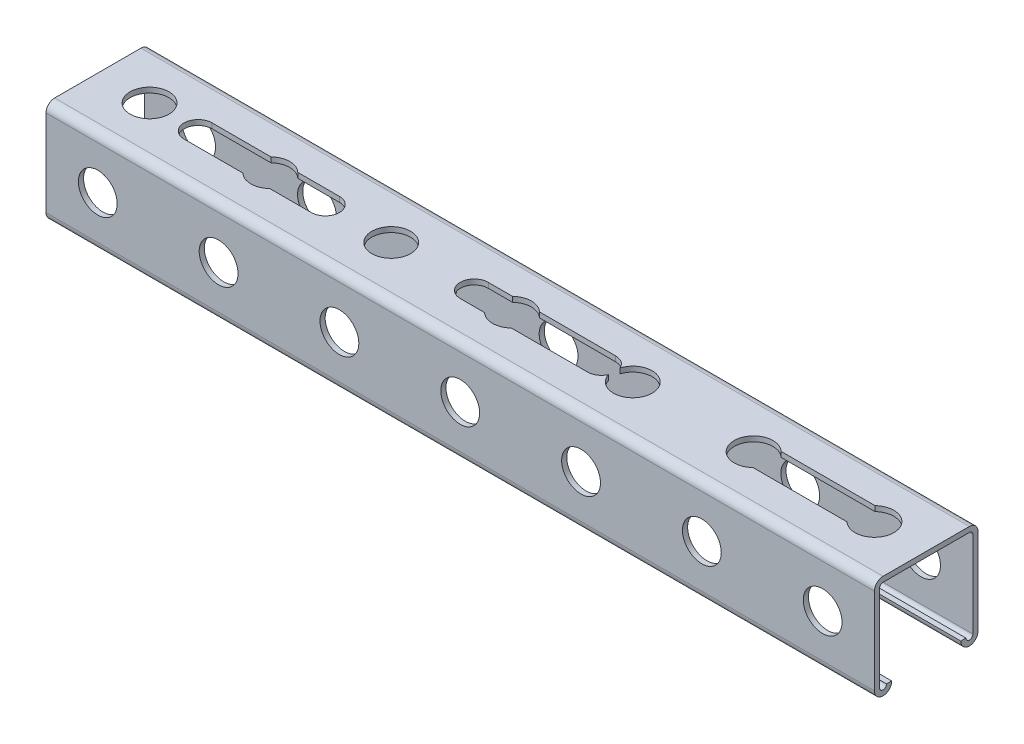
ISO-10303-21;
HEADER;
FILE_DESCRIPTION(('STEP AP214'),'2;1');
FILE_NAME('part.step','',(''),(''),'','','');
FILE_SCHEMA(('AUTOMOTIVE_DESIGN { 1 0 10303 214 1 1 1 1 }'));
ENDSEC;
DATA;
#1=APPLICATION_CONTEXT('core data for automotive mechanical design processes');
#2=APPLICATION_PROTOCOL_DEFINITION('international standard','automotive_design',2000,#1);
#3=PRODUCT_CONTEXT('',#1,'mechanical');
#4=PRODUCT('Part','Part','',(#3));
#5=PRODUCT_RELATED_PRODUCT_CATEGORY('part','',(#4));
#6=PRODUCT_DEFINITION_FORMATION('','',#4);
#7=PRODUCT_DEFINITION_CONTEXT('part definition',#1,'design');
#8=PRODUCT_DEFINITION('design','',#6,#7);
#9=PRODUCT_DEFINITION_SHAPE('','',#8);
#10=(LENGTH_UNIT() NAMED_UNIT(*) SI_UNIT(.MILLI.,.METRE.));
#11=(NAMED_UNIT(*) PLANE_ANGLE_UNIT() SI_UNIT($,.RADIAN.));
#12=(NAMED_UNIT(*) SI_UNIT($,.STERADIAN.) SOLID_ANGLE_UNIT());
#13=UNCERTAINTY_MEASURE_WITH_UNIT(LENGTH_MEASURE(1.E-05),#10,'distance_accuracy_value','');
#14=(GEOMETRIC_REPRESENTATION_CONTEXT(3) GLOBAL_UNCERTAINTY_ASSIGNED_CONTEXT((#13)) GLOBAL_UNIT_ASSIGNED_CONTEXT((#10,
#11,#12)) REPRESENTATION_CONTEXT('',''));
#15=CARTESIAN_POINT('',(0.,0.,0.));
#16=DIRECTION('',(0.,0.,1.));
#17=DIRECTION('',(1.,0.,0.));
#18=AXIS2_PLACEMENT_3D('',#15,#16,#17);
#19=CARTESIAN_POINT('',(63.5,-38.1000000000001,2.66453525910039E-13));
#20=DIRECTION('',(0.,1.,0.));
#21=DIRECTION('',(0.,0.,1.));
#22=AXIS2_PLACEMENT_3D('',#19,#20,#21);
#23=CYLINDRICAL_SURFACE('',#22,7.14375000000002);
#24=CARTESIAN_POINT('',(63.5,0.,0.));
#25=DIRECTION('',(0.,1.,0.));
#26=DIRECTION('',(0.,0.,1.));
#27=AXIS2_PLACEMENT_3D('',#24,#25,#26);
#28=CIRCLE('',#27,7.14375000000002);
#29=CARTESIAN_POINT('',(68.4410539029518,0.,-5.15937499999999));
#30=VERTEX_POINT('',#29);
#31=CARTESIAN_POINT('',(58.5589460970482,0.,-5.15937499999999));
#32=VERTEX_POINT('',#31);
#33=EDGE_CURVE('E364',#30,#32,#28,.T.);
#34=ORIENTED_EDGE('',*,*,#33,.T.);
#35=DIRECTION('',(0.,1.,0.));
#36=VECTOR('',#35,1.);
#37=CARTESIAN_POINT('',(58.5589460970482,-38.1000000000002,-5.15937499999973));
#38=LINE('',#37,#36);
#39=CARTESIAN_POINT('',(58.5589460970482,-1.905,-5.15937499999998));
#40=VERTEX_POINT('',#39);
#41=EDGE_CURVE('E645',#32,#40,#38,.F.);
#42=ORIENTED_EDGE('',*,*,#41,.T.);
#43=CARTESIAN_POINT('',(63.5,-1.905,0.));
#44=DIRECTION('',(0.,1.,0.));
#45=DIRECTION('',(0.,0.,1.));
#46=AXIS2_PLACEMENT_3D('',#43,#44,#45);
#47=CIRCLE('',#46,7.14375000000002);
#48=CARTESIAN_POINT('',(68.4410539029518,-1.905,-5.15937499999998));
#49=VERTEX_POINT('',#48);
#50=EDGE_CURVE('E369',#49,#40,#47,.T.);
#51=ORIENTED_EDGE('',*,*,#50,.F.);
#52=DIRECTION('',(0.,1.,0.));
#53=VECTOR('',#52,1.);
#54=CARTESIAN_POINT('',(68.4410539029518,-38.1000000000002,-5.15937499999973));
#55=LINE('',#54,#53);
#56=EDGE_CURVE('E642',#49,#30,#55,.T.);
#57=ORIENTED_EDGE('',*,*,#56,.T.);
#58=EDGE_LOOP('',(#34,#42,#51,#57));
#59=FACE_BOUND('',#58,.T.);
#60=ADVANCED_FACE('F29',(#59),#23,.F.);
#61=CARTESIAN_POINT('',(152.4,-38.1000000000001,2.66453525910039E-13));
#62=DIRECTION('',(0.,1.,0.));
#63=DIRECTION('',(0.,0.,1.));
#64=AXIS2_PLACEMENT_3D('',#61,#62,#63);
#65=CYLINDRICAL_SURFACE('',#64,7.14375000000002);
#66=CARTESIAN_POINT('',(152.4,0.,0.));
#67=DIRECTION('',(0.,1.,0.));
#68=DIRECTION('',(0.,0.,1.));
#69=AXIS2_PLACEMENT_3D('',#66,#67,#68);
#70=CIRCLE('',#69,7.14375000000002);
#71=CARTESIAN_POINT('',(157.341053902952,0.,-5.159375));
#72=VERTEX_POINT('',#71);
#73=CARTESIAN_POINT('',(147.458946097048,0.,-5.159375));
#74=VERTEX_POINT('',#73);
#75=EDGE_CURVE('E373',#72,#74,#70,.T.);
#76=ORIENTED_EDGE('',*,*,#75,.T.);
#77=DIRECTION('',(0.,1.,0.));
#78=VECTOR('',#77,1.);
#79=CARTESIAN_POINT('',(147.458946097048,-38.1000000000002,-5.15937499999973));
#80=LINE('',#79,#78);
#81=CARTESIAN_POINT('',(147.458946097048,-1.905,-5.15937499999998));
#82=VERTEX_POINT('',#81);
#83=EDGE_CURVE('E626',#74,#82,#80,.F.);
#84=ORIENTED_EDGE('',*,*,#83,.T.);
#85=CARTESIAN_POINT('',(152.4,-1.905,0.));
#86=DIRECTION('',(0.,1.,0.));
#87=DIRECTION('',(0.,0.,1.));
#88=AXIS2_PLACEMENT_3D('',#85,#86,#87);
#89=CIRCLE('',#88,7.14375000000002);
#90=CARTESIAN_POINT('',(157.341053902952,-1.905,-5.15937499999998));
#91=VERTEX_POINT('',#90);
#92=EDGE_CURVE('E378',#91,#82,#89,.T.);
#93=ORIENTED_EDGE('',*,*,#92,.F.);
#94=DIRECTION('',(0.,1.,0.));
#95=VECTOR('',#94,1.);
#96=CARTESIAN_POINT('',(157.341053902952,-38.1000000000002,-5.15937499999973));
#97=LINE('',#96,#95);
#98=EDGE_CURVE('E623',#91,#72,#97,.T.);
#99=ORIENTED_EDGE('',*,*,#98,.T.);
#100=EDGE_LOOP('',(#76,#84,#93,#99));
#101=FACE_BOUND('',#100,.T.);
#102=ADVANCED_FACE('F679',(#101),#65,.F.);
#103=CARTESIAN_POINT('',(304.8,-34.925,-15.875));
#104=DIRECTION('',(-1.,0.,0.));
#105=DIRECTION('',(0.,0.,1.));
#106=AXIS2_PLACEMENT_3D('',#103,#104,#105);
#107=CYLINDRICAL_SURFACE('',#106,1.27);
#108=CARTESIAN_POINT('',(0.,-34.925,-15.875));
#109=DIRECTION('',(1.,0.,0.));
#110=DIRECTION('',(0.,0.,1.));
#111=AXIS2_PLACEMENT_3D('',#108,#109,#110);
#112=CIRCLE('',#111,1.27);
#113=CARTESIAN_POINT('',(0.,-34.925,-17.145));
#114=VERTEX_POINT('',#113);
#115=CARTESIAN_POINT('',(0.,-34.925,-14.605));
#116=VERTEX_POINT('',#115);
#117=EDGE_CURVE('E411',#114,#116,#112,.F.);
#118=ORIENTED_EDGE('',*,*,#117,.T.);
#119=DIRECTION('',(-1.,0.,0.));
#120=VECTOR('',#119,1.);
#121=CARTESIAN_POINT('',(304.8,-34.925,-14.605));
#122=LINE('',#121,#120);
#123=CARTESIAN_POINT('',(304.8,-34.925,-14.605));
#124=VERTEX_POINT('',#123);
#125=EDGE_CURVE('E530',#124,#116,#122,.T.);
#126=ORIENTED_EDGE('',*,*,#125,.F.);
#127=CARTESIAN_POINT('',(304.8,-34.925,-15.875));
#128=DIRECTION('',(1.,0.,0.));
#129=DIRECTION('',(0.,0.,1.));
#130=AXIS2_PLACEMENT_3D('',#127,#128,#129);
#131=CIRCLE('',#130,1.27);
#132=CARTESIAN_POINT('',(304.8,-34.925,-17.145));
#133=VERTEX_POINT('',#132);
#134=EDGE_CURVE('E453',#133,#124,#131,.F.);
#135=ORIENTED_EDGE('',*,*,#134,.F.);
#136=DIRECTION('',(-1.,0.,0.));
#137=VECTOR('',#136,1.);
#138=CARTESIAN_POINT('',(304.8,-34.925,-17.145));
#139=LINE('',#138,#137);
#140=EDGE_CURVE('E494',#133,#114,#139,.T.);
#141=ORIENTED_EDGE('',*,*,#140,.T.);
#142=EDGE_LOOP('',(#118,#126,#135,#141));
#143=FACE_BOUND('',#142,.T.);
#144=ADVANCED_FACE('F686',(#143),#107,.F.);
#145=CARTESIAN_POINT('',(304.8,-34.925,-12.7));
#146=DIRECTION('',(0.,1.,0.));
#147=DIRECTION('',(0.,0.,1.));
#148=AXIS2_PLACEMENT_3D('',#145,#146,#147);
#149=PLANE('',#148);
#150=DIRECTION('',(0.,0.,-1.));
#151=VECTOR('',#150,1.);
#152=CARTESIAN_POINT('',(0.,-34.925,-12.7));
#153=LINE('',#152,#151);
#154=CARTESIAN_POINT('',(0.,-34.925,-12.7));
#155=VERTEX_POINT('',#154);
#156=EDGE_CURVE('E414',#155,#116,#153,.T.);
#157=ORIENTED_EDGE('',*,*,#156,.F.);
#158=DIRECTION('',(-1.,0.,0.));
#159=VECTOR('',#158,1.);
#160=CARTESIAN_POINT('',(304.8,-34.925,-12.7));
#161=LINE('',#160,#159);
#162=CARTESIAN_POINT('',(304.8,-34.925,-12.7));
#163=VERTEX_POINT('',#162);
#164=EDGE_CURVE('E528',#163,#155,#161,.T.);
#165=ORIENTED_EDGE('',*,*,#164,.F.);
#166=DIRECTION('',(0.,0.,-1.));
#167=VECTOR('',#166,1.);
#168=CARTESIAN_POINT('',(304.8,-34.925,-12.7));
#169=LINE('',#168,#167);
#170=EDGE_CURVE('E455',#163,#124,#169,.T.);
#171=ORIENTED_EDGE('',*,*,#170,.T.);
#172=ORIENTED_EDGE('',*,*,#125,.T.);
#173=EDGE_LOOP('',(#157,#165,#171,#172));
#174=FACE_BOUND('',#173,.T.);
#175=ADVANCED_FACE('F796',(#174),#149,.T.);
#176=CARTESIAN_POINT('',(304.8,-34.925,-15.875));
#177=DIRECTION('',(-1.,0.,0.));
#178=DIRECTION('',(0.,0.,1.));
#179=AXIS2_PLACEMENT_3D('',#176,#177,#178);
#180=CYLINDRICAL_SURFACE('',#179,3.175);
#181=CARTESIAN_POINT('',(0.,-34.925,-15.875));
#182=DIRECTION('',(-1.,0.,0.));
#183=DIRECTION('',(0.,0.,1.));
#184=AXIS2_PLACEMENT_3D('',#181,#182,#183);
#185=CIRCLE('',#184,3.175);
#186=CARTESIAN_POINT('',(0.,-34.925,-19.05));
#187=VERTEX_POINT('',#186);
#188=EDGE_CURVE('E417',#187,#155,#185,.T.);
#189=ORIENTED_EDGE('',*,*,#188,.F.);
#190=DIRECTION('',(-1.,0.,0.));
#191=VECTOR('',#190,1.);
#192=CARTESIAN_POINT('',(304.8,-34.925,-19.05));
#193=LINE('',#192,#191);
#194=CARTESIAN_POINT('',(304.8,-34.925,-19.05));
#195=VERTEX_POINT('',#194);
#196=EDGE_CURVE('E526',#195,#187,#193,.T.);
#197=ORIENTED_EDGE('',*,*,#196,.F.);
#198=CARTESIAN_POINT('',(304.8,-34.925,-15.875));
#199=DIRECTION('',(-1.,0.,0.));
#200=DIRECTION('',(0.,0.,1.));
#201=AXIS2_PLACEMENT_3D('',#198,#199,#200);
#202=CIRCLE('',#201,3.175);
#203=EDGE_CURVE('E458',#195,#163,#202,.T.);
#204=ORIENTED_EDGE('',*,*,#203,.T.);
#205=ORIENTED_EDGE('',*,*,#164,.T.);
#206=EDGE_LOOP('',(#189,#197,#204,#205));
#207=FACE_BOUND('',#206,.T.);
#208=ADVANCED_FACE('F792',(#207),#180,.T.);
#209=CARTESIAN_POINT('',(304.8,-3.175,-19.05));
#210=DIRECTION('',(0.,0.,-1.));
#211=DIRECTION('',(0.,1.,0.));
#212=AXIS2_PLACEMENT_3D('',#209,#210,#211);
#213=PLANE('',#212);
#214=CARTESIAN_POINT('',(241.3,-19.05,-19.05));
#215=DIRECTION('',(0.,0.,1.));
#216=DIRECTION('',(1.,0.,0.));
#217=AXIS2_PLACEMENT_3D('',#214,#215,#216);
#218=CIRCLE('',#217,7.14375000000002);
#219=CARTESIAN_POINT('',(248.44375,-19.05,-19.05));
#220=VERTEX_POINT('',#219);
#221=EDGE_CURVE('E347',#220,#220,#218,.T.);
#222=ORIENTED_EDGE('',*,*,#221,.T.);
#223=EDGE_LOOP('',(#222));
#224=FACE_BOUND('',#223,.T.);
#225=CARTESIAN_POINT('',(285.75,-19.05,-19.05));
#226=DIRECTION('',(0.,0.,1.));
#227=DIRECTION('',(1.,0.,0.));
#228=AXIS2_PLACEMENT_3D('',#225,#226,#227);
#229=CIRCLE('',#228,7.14375000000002);
#230=CARTESIAN_POINT('',(292.89375,-19.05,-19.05));
#231=VERTEX_POINT('',#230);
#232=EDGE_CURVE('E400',#231,#231,#229,.T.);
#233=ORIENTED_EDGE('',*,*,#232,.T.);
#234=EDGE_LOOP('',(#233));
#235=FACE_BOUND('',#234,.T.);
#236=DIRECTION('',(0.,-1.,0.));
#237=VECTOR('',#236,1.);
#238=CARTESIAN_POINT('',(0.,-3.175,-19.05));
#239=LINE('',#238,#237);
#240=CARTESIAN_POINT('',(0.,-3.175,-19.05));
#241=VERTEX_POINT('',#240);
#242=EDGE_CURVE('E420',#241,#187,#239,.T.);
#243=ORIENTED_EDGE('',*,*,#242,.F.);
#244=DIRECTION('',(-1.,0.,0.));
#245=VECTOR('',#244,1.);
#246=CARTESIAN_POINT('',(304.8,-3.175,-19.05));
#247=LINE('',#246,#245);
#248=CARTESIAN_POINT('',(304.8,-3.175,-19.05));
#249=VERTEX_POINT('',#248);
#250=EDGE_CURVE('E524',#249,#241,#247,.T.);
#251=ORIENTED_EDGE('',*,*,#250,.F.);
#252=DIRECTION('',(0.,-1.,0.));
#253=VECTOR('',#252,1.);
#254=CARTESIAN_POINT('',(304.8,-3.175,-19.05));
#255=LINE('',#254,#253);
#256=EDGE_CURVE('E461',#249,#195,#255,.T.);
#257=ORIENTED_EDGE('',*,*,#256,.T.);
#258=ORIENTED_EDGE('',*,*,#196,.T.);
#259=EDGE_LOOP('',(#243,#251,#257,#258));
#260=FACE_BOUND('',#259,.T.);
#261=CARTESIAN_POINT('',(196.85,-19.05,-19.05));
#262=DIRECTION('',(0.,0.,1.));
#263=DIRECTION('',(1.,0.,0.));
#264=AXIS2_PLACEMENT_3D('',#261,#262,#263);
#265=CIRCLE('',#264,7.14375000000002);
#266=CARTESIAN_POINT('',(203.99375,-19.05,-19.05));
#267=VERTEX_POINT('',#266);
#268=EDGE_CURVE('E587',#267,#267,#265,.T.);
#269=ORIENTED_EDGE('',*,*,#268,.T.);
#270=EDGE_LOOP('',(#269));
#271=FACE_BOUND('',#270,.T.);
#272=CARTESIAN_POINT('',(152.4,-19.05,-19.05));
#273=DIRECTION('',(0.,0.,1.));
#274=DIRECTION('',(1.,0.,0.));
#275=AXIS2_PLACEMENT_3D('',#272,#273,#274);
#276=CIRCLE('',#275,7.14375000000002);
#277=CARTESIAN_POINT('',(159.54375,-19.05,-19.05));
#278=VERTEX_POINT('',#277);
#279=EDGE_CURVE('E593',#278,#278,#276,.T.);
#280=ORIENTED_EDGE('',*,*,#279,.T.);
#281=EDGE_LOOP('',(#280));
#282=FACE_BOUND('',#281,.T.);
#283=CARTESIAN_POINT('',(107.95,-19.05,-19.05));
#284=DIRECTION('',(0.,0.,1.));
#285=DIRECTION('',(1.,0.,0.));
#286=AXIS2_PLACEMENT_3D('',#283,#284,#285);
#287=CIRCLE('',#286,7.14375000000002);
#288=CARTESIAN_POINT('',(115.09375,-19.05,-19.05));
#289=VERTEX_POINT('',#288);
#290=EDGE_CURVE('E599',#289,#289,#287,.T.);
#291=ORIENTED_EDGE('',*,*,#290,.T.);
#292=EDGE_LOOP('',(#291));
#293=FACE_BOUND('',#292,.T.);
#294=CARTESIAN_POINT('',(63.5,-19.05,-19.05));
#295=DIRECTION('',(0.,0.,1.));
#296=DIRECTION('',(1.,0.,0.));
#297=AXIS2_PLACEMENT_3D('',#294,#295,#296);
#298=CIRCLE('',#297,7.14375000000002);
#299=CARTESIAN_POINT('',(70.64375,-19.05,-19.05));
#300=VERTEX_POINT('',#299);
#301=EDGE_CURVE('E605',#300,#300,#298,.T.);
#302=ORIENTED_EDGE('',*,*,#301,.T.);
#303=EDGE_LOOP('',(#302));
#304=FACE_BOUND('',#303,.T.);
#305=CARTESIAN_POINT('',(19.05,-19.05,-19.05));
#306=DIRECTION('',(0.,0.,1.));
#307=DIRECTION('',(1.,0.,0.));
#308=AXIS2_PLACEMENT_3D('',#305,#306,#307);
#309=CIRCLE('',#308,7.14375000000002);
#310=CARTESIAN_POINT('',(26.19375,-19.05,-19.05));
#311=VERTEX_POINT('',#310);
#312=EDGE_CURVE('E611',#311,#311,#309,.T.);
#313=ORIENTED_EDGE('',*,*,#312,.T.);
#314=EDGE_LOOP('',(#313));
#315=FACE_BOUND('',#314,.T.);
#316=ADVANCED_FACE('F788',(#224,#235,#260,#271,#282,#293,#304,#315),#213,.T.);
#317=CARTESIAN_POINT('',(304.8,-3.175,-15.875));
#318=DIRECTION('',(-1.,0.,0.));
#319=DIRECTION('',(0.,0.,1.));
#320=AXIS2_PLACEMENT_3D('',#317,#318,#319);
#321=CYLINDRICAL_SURFACE('',#320,3.17499999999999);
#322=CARTESIAN_POINT('',(0.,-3.175,-15.875));
#323=DIRECTION('',(-1.,0.,0.));
#324=DIRECTION('',(0.,0.,1.));
#325=AXIS2_PLACEMENT_3D('',#322,#323,#324);
#326=CIRCLE('',#325,3.17499999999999);
#327=CARTESIAN_POINT('',(0.,0.,-15.875));
#328=VERTEX_POINT('',#327);
#329=EDGE_CURVE('E423',#328,#241,#326,.T.);
#330=ORIENTED_EDGE('',*,*,#329,.F.);
#331=DIRECTION('',(-1.,0.,0.));
#332=VECTOR('',#331,1.);
#333=CARTESIAN_POINT('',(304.8,0.,-15.875));
#334=LINE('',#333,#332);
#335=CARTESIAN_POINT('',(304.8,0.,-15.875));
#336=VERTEX_POINT('',#335);
#337=EDGE_CURVE('E522',#336,#328,#334,.T.);
#338=ORIENTED_EDGE('',*,*,#337,.F.);
#339=CARTESIAN_POINT('',(304.8,-3.175,-15.875));
#340=DIRECTION('',(-1.,0.,0.));
#341=DIRECTION('',(0.,0.,1.));
#342=AXIS2_PLACEMENT_3D('',#339,#340,#341);
#343=CIRCLE('',#342,3.17499999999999);
#344=EDGE_CURVE('E464',#336,#249,#343,.T.);
#345=ORIENTED_EDGE('',*,*,#344,.T.);
#346=ORIENTED_EDGE('',*,*,#250,.T.);
#347=EDGE_LOOP('',(#330,#338,#345,#346));
#348=FACE_BOUND('',#347,.T.);
#349=ADVANCED_FACE('F785',(#348),#321,.T.);
#350=CARTESIAN_POINT('',(304.8,0.,-15.875));
#351=DIRECTION('',(0.,1.,0.));
#352=DIRECTION('',(0.,0.,1.));
#353=AXIS2_PLACEMENT_3D('',#350,#351,#352);
#354=PLANE('',#353);
#355=DIRECTION('',(-1.,0.,0.));
#356=VECTOR('',#355,1.);
#357=CARTESIAN_POINT('',(36.9093749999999,0.,-5.159375));
#358=LINE('',#357,#356);
#359=CARTESIAN_POINT('',(36.9093749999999,0.,-5.159375));
#360=VERTEX_POINT('',#359);
#361=EDGE_CURVE('E301',#32,#360,#358,.T.);
#362=ORIENTED_EDGE('',*,*,#361,.F.);
#363=ORIENTED_EDGE('',*,*,#33,.F.);
#364=CARTESIAN_POINT('',(83.740625,0.,-5.15937499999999));
#365=VERTEX_POINT('',#364);
#366=EDGE_CURVE('E280',#365,#30,#358,.T.);
#367=ORIENTED_EDGE('',*,*,#366,.F.);
#368=CARTESIAN_POINT('',(83.740625,0.,0.));
#369=DIRECTION('',(0.,1.,0.));
#370=DIRECTION('',(0.,0.,1.));
#371=AXIS2_PLACEMENT_3D('',#368,#369,#370);
#372=CIRCLE('',#371,5.15937499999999);
#373=CARTESIAN_POINT('',(83.740625,0.,5.159375));
#374=VERTEX_POINT('',#373);
#375=EDGE_CURVE('E298',#374,#365,#372,.T.);
#376=ORIENTED_EDGE('',*,*,#375,.F.);
#377=DIRECTION('',(1.,0.,0.));
#378=VECTOR('',#377,1.);
#379=CARTESIAN_POINT('',(36.9093749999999,0.,5.159375));
#380=LINE('',#379,#378);
#381=CARTESIAN_POINT('',(68.4410539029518,0.,5.159375));
#382=VERTEX_POINT('',#381);
#383=EDGE_CURVE('E290',#382,#374,#380,.T.);
#384=ORIENTED_EDGE('',*,*,#383,.F.);
#385=CARTESIAN_POINT('',(58.5589460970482,0.,5.159375));
#386=VERTEX_POINT('',#385);
#387=EDGE_CURVE('E297',#386,#382,#28,.T.);
#388=ORIENTED_EDGE('',*,*,#387,.F.);
#389=CARTESIAN_POINT('',(36.9093749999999,0.,5.159375));
#390=VERTEX_POINT('',#389);
#391=EDGE_CURVE('E52',#390,#386,#380,.T.);
#392=ORIENTED_EDGE('',*,*,#391,.F.);
#393=CARTESIAN_POINT('',(36.9093749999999,0.,0.));
#394=DIRECTION('',(0.,1.,0.));
#395=DIRECTION('',(0.,0.,-1.));
#396=AXIS2_PLACEMENT_3D('',#393,#394,#395);
#397=CIRCLE('',#396,5.159375);
#398=EDGE_CURVE('E283',#360,#390,#397,.T.);
#399=ORIENTED_EDGE('',*,*,#398,.F.);
#400=EDGE_LOOP('',(#362,#363,#367,#376,#384,#388,#392,#399));
#401=FACE_BOUND('',#400,.T.);
#402=DIRECTION('',(-1.,0.,0.));
#403=VECTOR('',#402,1.);
#404=CARTESIAN_POINT('',(138.509375,0.,-5.159375));
#405=LINE('',#404,#403);
#406=CARTESIAN_POINT('',(185.340625,0.,-5.15937499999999));
#407=VERTEX_POINT('',#406);
#408=EDGE_CURVE('E325',#407,#72,#405,.T.);
#409=ORIENTED_EDGE('',*,*,#408,.F.);
#410=CARTESIAN_POINT('',(185.340625,0.,0.));
#411=DIRECTION('',(0.,1.,0.));
#412=DIRECTION('',(0.,0.,1.));
#413=AXIS2_PLACEMENT_3D('',#410,#411,#412);
#414=CIRCLE('',#413,5.15937499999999);
#415=CARTESIAN_POINT('',(190.034698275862,0.,-2.14122078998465));
#416=VERTEX_POINT('',#415);
#417=EDGE_CURVE('E321',#416,#407,#414,.T.);
#418=ORIENTED_EDGE('',*,*,#417,.F.);
#419=CARTESIAN_POINT('',(196.85,0.,0.));
#420=DIRECTION('',(0.,1.,0.));
#421=DIRECTION('',(0.,0.,1.));
#422=AXIS2_PLACEMENT_3D('',#419,#420,#421);
#423=CIRCLE('',#422,7.14375000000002);
#424=CARTESIAN_POINT('',(190.034698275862,0.,2.14122078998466));
#425=VERTEX_POINT('',#424);
#426=EDGE_CURVE('E374',#425,#416,#423,.T.);
#427=ORIENTED_EDGE('',*,*,#426,.F.);
#428=CARTESIAN_POINT('',(185.340625,0.,5.159375));
#429=VERTEX_POINT('',#428);
#430=EDGE_CURVE('E322',#429,#425,#414,.T.);
#431=ORIENTED_EDGE('',*,*,#430,.F.);
#432=DIRECTION('',(1.,0.,0.));
#433=VECTOR('',#432,1.);
#434=CARTESIAN_POINT('',(138.509375,0.,5.159375));
#435=LINE('',#434,#433);
#436=CARTESIAN_POINT('',(157.341053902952,0.,5.159375));
#437=VERTEX_POINT('',#436);
#438=EDGE_CURVE('E318',#437,#429,#435,.T.);
#439=ORIENTED_EDGE('',*,*,#438,.F.);
#440=CARTESIAN_POINT('',(147.458946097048,0.,5.159375));
#441=VERTEX_POINT('',#440);
#442=EDGE_CURVE('E370',#441,#437,#70,.T.);
#443=ORIENTED_EDGE('',*,*,#442,.F.);
#444=CARTESIAN_POINT('',(138.509375,0.,5.159375));
#445=VERTEX_POINT('',#444);
#446=EDGE_CURVE('E319',#445,#441,#435,.T.);
#447=ORIENTED_EDGE('',*,*,#446,.F.);
#448=CARTESIAN_POINT('',(138.509375,0.,0.));
#449=DIRECTION('',(0.,1.,0.));
#450=DIRECTION('',(0.,0.,-1.));
#451=AXIS2_PLACEMENT_3D('',#448,#449,#450);
#452=CIRCLE('',#451,5.159375);
#453=CARTESIAN_POINT('',(138.509375,0.,-5.159375));
#454=VERTEX_POINT('',#453);
#455=EDGE_CURVE('E315',#454,#445,#452,.T.);
#456=ORIENTED_EDGE('',*,*,#455,.F.);
#457=EDGE_CURVE('E324',#74,#454,#405,.T.);
#458=ORIENTED_EDGE('',*,*,#457,.F.);
#459=ORIENTED_EDGE('',*,*,#75,.F.);
#460=EDGE_LOOP('',(#409,#418,#427,#431,#439,#443,#447,#456,#458,#459));
#461=FACE_BOUND('',#460,.T.);
#462=CARTESIAN_POINT('',(19.05,0.,0.));
#463=DIRECTION('',(0.,1.,0.));
#464=DIRECTION('',(0.,0.,1.));
#465=AXIS2_PLACEMENT_3D('',#462,#463,#464);
#466=CIRCLE('',#465,7.14375000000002);
#467=CARTESIAN_POINT('',(19.05,0.,7.14375000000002));
#468=VERTEX_POINT('',#467);
#469=EDGE_CURVE('E359',#468,#468,#466,.T.);
#470=ORIENTED_EDGE('',*,*,#469,.F.);
#471=EDGE_LOOP('',(#470));
#472=FACE_BOUND('',#471,.T.);
#473=CARTESIAN_POINT('',(107.95,0.,0.));
#474=DIRECTION('',(0.,1.,0.));
#475=DIRECTION('',(0.,0.,1.));
#476=AXIS2_PLACEMENT_3D('',#473,#474,#475);
#477=CIRCLE('',#476,7.14375000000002);
#478=CARTESIAN_POINT('',(107.95,0.,7.14375000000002));
#479=VERTEX_POINT('',#478);
#480=EDGE_CURVE('E365',#479,#479,#477,.T.);
#481=ORIENTED_EDGE('',*,*,#480,.F.);
#482=EDGE_LOOP('',(#481));
#483=FACE_BOUND('',#482,.T.);
#484=CARTESIAN_POINT('',(241.3,0.,0.));
#485=DIRECTION('',(0.,1.,0.));
#486=DIRECTION('',(0.,0.,1.));
#487=AXIS2_PLACEMENT_3D('',#484,#485,#486);
#488=CIRCLE('',#487,7.14375000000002);
#489=CARTESIAN_POINT('',(246.241053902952,0.,-5.159375));
#490=VERTEX_POINT('',#489);
#491=CARTESIAN_POINT('',(246.241053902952,0.,5.159375));
#492=VERTEX_POINT('',#491);
#493=EDGE_CURVE('E379',#490,#492,#488,.T.);
#494=ORIENTED_EDGE('',*,*,#493,.F.);
#495=DIRECTION('',(-1.,0.,0.));
#496=VECTOR('',#495,1.);
#497=CARTESIAN_POINT('',(240.109375,0.,-5.159375));
#498=LINE('',#497,#496);
#499=CARTESIAN_POINT('',(280.808946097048,0.,-5.15937499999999));
#500=VERTEX_POINT('',#499);
#501=EDGE_CURVE('E389',#500,#490,#498,.T.);
#502=ORIENTED_EDGE('',*,*,#501,.F.);
#503=CARTESIAN_POINT('',(285.75,0.,0.));
#504=DIRECTION('',(0.,1.,0.));
#505=DIRECTION('',(0.,0.,1.));
#506=AXIS2_PLACEMENT_3D('',#503,#504,#505);
#507=CIRCLE('',#506,7.14375000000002);
#508=CARTESIAN_POINT('',(280.808946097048,0.,5.159375));
#509=VERTEX_POINT('',#508);
#510=EDGE_CURVE('E407',#509,#500,#507,.T.);
#511=ORIENTED_EDGE('',*,*,#510,.F.);
#512=DIRECTION('',(1.,0.,0.));
#513=VECTOR('',#512,1.);
#514=CARTESIAN_POINT('',(240.109375,0.,5.159375));
#515=LINE('',#514,#513);
#516=EDGE_CURVE('E387',#492,#509,#515,.T.);
#517=ORIENTED_EDGE('',*,*,#516,.F.);
#518=EDGE_LOOP('',(#494,#502,#511,#517));
#519=FACE_BOUND('',#518,.T.);
#520=DIRECTION('',(0.,0.,-1.));
#521=VECTOR('',#520,1.);
#522=CARTESIAN_POINT('',(0.,0.,-15.875));
#523=LINE('',#522,#521);
#524=CARTESIAN_POINT('',(0.,0.,15.875));
#525=VERTEX_POINT('',#524);
#526=EDGE_CURVE('E426',#525,#328,#523,.T.);
#527=ORIENTED_EDGE('',*,*,#526,.F.);
#528=DIRECTION('',(-1.,0.,0.));
#529=VECTOR('',#528,1.);
#530=CARTESIAN_POINT('',(304.8,0.,15.875));
#531=LINE('',#530,#529);
#532=CARTESIAN_POINT('',(304.8,0.,15.875));
#533=VERTEX_POINT('',#532);
#534=EDGE_CURVE('E520',#533,#525,#531,.T.);
#535=ORIENTED_EDGE('',*,*,#534,.F.);
#536=DIRECTION('',(0.,0.,-1.));
#537=VECTOR('',#536,1.);
#538=CARTESIAN_POINT('',(304.8,0.,-15.875));
#539=LINE('',#538,#537);
#540=EDGE_CURVE('E467',#533,#336,#539,.T.);
#541=ORIENTED_EDGE('',*,*,#540,.T.);
#542=ORIENTED_EDGE('',*,*,#337,.T.);
#543=EDGE_LOOP('',(#527,#535,#541,#542));
#544=FACE_BOUND('',#543,.T.);
#545=ADVANCED_FACE('F293',(#401,#461,#472,#483,#519,#544),#354,.T.);
#546=CARTESIAN_POINT('',(304.8,-3.175,15.875));
#547=DIRECTION('',(-1.,0.,0.));
#548=DIRECTION('',(0.,0.,1.));
#549=AXIS2_PLACEMENT_3D('',#546,#547,#548);
#550=CYLINDRICAL_SURFACE('',#549,3.17499999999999);
#551=CARTESIAN_POINT('',(0.,-3.175,15.875));
#552=DIRECTION('',(-1.,0.,0.));
#553=DIRECTION('',(0.,0.,-1.));
#554=AXIS2_PLACEMENT_3D('',#551,#552,#553);
#555=CIRCLE('',#554,3.17499999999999);
#556=CARTESIAN_POINT('',(0.,-3.175,19.05));
#557=VERTEX_POINT('',#556);
#558=EDGE_CURVE('E429',#557,#525,#555,.T.);
#559=ORIENTED_EDGE('',*,*,#558,.F.);
#560=DIRECTION('',(-1.,0.,0.));
#561=VECTOR('',#560,1.);
#562=CARTESIAN_POINT('',(304.8,-3.175,19.05));
#563=LINE('',#562,#561);
#564=CARTESIAN_POINT('',(304.8,-3.175,19.05));
#565=VERTEX_POINT('',#564);
#566=EDGE_CURVE('E518',#565,#557,#563,.T.);
#567=ORIENTED_EDGE('',*,*,#566,.F.);
#568=CARTESIAN_POINT('',(304.8,-3.175,15.875));
#569=DIRECTION('',(-1.,0.,0.));
#570=DIRECTION('',(0.,0.,-1.));
#571=AXIS2_PLACEMENT_3D('',#568,#569,#570);
#572=CIRCLE('',#571,3.17499999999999);
#573=EDGE_CURVE('E470',#565,#533,#572,.T.);
#574=ORIENTED_EDGE('',*,*,#573,.T.);
#575=ORIENTED_EDGE('',*,*,#534,.T.);
#576=EDGE_LOOP('',(#559,#567,#574,#575));
#577=FACE_BOUND('',#576,.T.);
#578=ADVANCED_FACE('F778',(#577),#550,.T.);
#579=CARTESIAN_POINT('',(304.8,-3.175,19.05));
#580=DIRECTION('',(0.,0.,1.));
#581=DIRECTION('',(0.,-1.,0.));
#582=AXIS2_PLACEMENT_3D('',#579,#580,#581);
#583=PLANE('',#582);
#584=CARTESIAN_POINT('',(241.3,-19.05,19.0499999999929));
#585=DIRECTION('',(0.,0.,1.));
#586=DIRECTION('',(1.,0.,0.));
#587=AXIS2_PLACEMENT_3D('',#584,#585,#586);
#588=CIRCLE('',#587,7.14375000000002);
#589=CARTESIAN_POINT('',(248.44375,-19.05,19.0499999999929));
#590=VERTEX_POINT('',#589);
#591=EDGE_CURVE('E353',#590,#590,#588,.T.);
#592=ORIENTED_EDGE('',*,*,#591,.F.);
#593=EDGE_LOOP('',(#592));
#594=FACE_BOUND('',#593,.T.);
#595=CARTESIAN_POINT('',(285.75,-19.05,19.0499999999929));
#596=DIRECTION('',(0.,0.,1.));
#597=DIRECTION('',(1.,0.,0.));
#598=AXIS2_PLACEMENT_3D('',#595,#596,#597);
#599=CIRCLE('',#598,7.14375000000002);
#600=CARTESIAN_POINT('',(292.89375,-19.05,19.0499999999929));
#601=VERTEX_POINT('',#600);
#602=EDGE_CURVE('E397',#601,#601,#599,.T.);
#603=ORIENTED_EDGE('',*,*,#602,.F.);
#604=EDGE_LOOP('',(#603));
#605=FACE_BOUND('',#604,.T.);
#606=DIRECTION('',(0.,1.,0.));
#607=VECTOR('',#606,1.);
#608=CARTESIAN_POINT('',(0.,-3.175,19.05));
#609=LINE('',#608,#607);
#610=CARTESIAN_POINT('',(0.,-34.925,19.05));
#611=VERTEX_POINT('',#610);
#612=EDGE_CURVE('E432',#611,#557,#609,.T.);
#613=ORIENTED_EDGE('',*,*,#612,.F.);
#614=DIRECTION('',(-1.,0.,0.));
#615=VECTOR('',#614,1.);
#616=CARTESIAN_POINT('',(304.8,-34.925,19.05));
#617=LINE('',#616,#615);
#618=CARTESIAN_POINT('',(304.8,-34.925,19.05));
#619=VERTEX_POINT('',#618);
#620=EDGE_CURVE('E516',#619,#611,#617,.T.);
#621=ORIENTED_EDGE('',*,*,#620,.F.);
#622=DIRECTION('',(0.,1.,0.));
#623=VECTOR('',#622,1.);
#624=CARTESIAN_POINT('',(304.8,-3.175,19.05));
#625=LINE('',#624,#623);
#626=EDGE_CURVE('E473',#619,#565,#625,.T.);
#627=ORIENTED_EDGE('',*,*,#626,.T.);
#628=ORIENTED_EDGE('',*,*,#566,.T.);
#629=EDGE_LOOP('',(#613,#621,#627,#628));
#630=FACE_BOUND('',#629,.T.);
#631=CARTESIAN_POINT('',(196.85,-19.05,19.0499999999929));
#632=DIRECTION('',(0.,0.,1.));
#633=DIRECTION('',(1.,0.,0.));
#634=AXIS2_PLACEMENT_3D('',#631,#632,#633);
#635=CIRCLE('',#634,7.14375000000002);
#636=CARTESIAN_POINT('',(203.99375,-19.05,19.0499999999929));
#637=VERTEX_POINT('',#636);
#638=EDGE_CURVE('E545',#637,#637,#635,.T.);
#639=ORIENTED_EDGE('',*,*,#638,.F.);
#640=EDGE_LOOP('',(#639));
#641=FACE_BOUND('',#640,.T.);
#642=CARTESIAN_POINT('',(152.4,-19.05,19.0499999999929));
#643=DIRECTION('',(0.,0.,1.));
#644=DIRECTION('',(1.,0.,0.));
#645=AXIS2_PLACEMENT_3D('',#642,#643,#644);
#646=CIRCLE('',#645,7.14375000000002);
#647=CARTESIAN_POINT('',(159.54375,-19.05,19.0499999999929));
#648=VERTEX_POINT('',#647);
#649=EDGE_CURVE('E563',#648,#648,#646,.T.);
#650=ORIENTED_EDGE('',*,*,#649,.F.);
#651=EDGE_LOOP('',(#650));
#652=FACE_BOUND('',#651,.T.);
#653=CARTESIAN_POINT('',(107.95,-19.05,19.0499999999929));
#654=DIRECTION('',(0.,0.,1.));
#655=DIRECTION('',(1.,0.,0.));
#656=AXIS2_PLACEMENT_3D('',#653,#654,#655);
#657=CIRCLE('',#656,7.14375000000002);
#658=CARTESIAN_POINT('',(115.09375,-19.05,19.0499999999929));
#659=VERTEX_POINT('',#658);
#660=EDGE_CURVE('E569',#659,#659,#657,.T.);
#661=ORIENTED_EDGE('',*,*,#660,.F.);
#662=EDGE_LOOP('',(#661));
#663=FACE_BOUND('',#662,.T.);
#664=CARTESIAN_POINT('',(63.5,-19.05,19.0499999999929));
#665=DIRECTION('',(0.,0.,1.));
#666=DIRECTION('',(1.,0.,0.));
#667=AXIS2_PLACEMENT_3D('',#664,#665,#666);
#668=CIRCLE('',#667,7.14375000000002);
#669=CARTESIAN_POINT('',(70.64375,-19.05,19.0499999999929));
#670=VERTEX_POINT('',#669);
#671=EDGE_CURVE('E575',#670,#670,#668,.T.);
#672=ORIENTED_EDGE('',*,*,#671,.F.);
#673=EDGE_LOOP('',(#672));
#674=FACE_BOUND('',#673,.T.);
#675=CARTESIAN_POINT('',(19.05,-19.05,19.0499999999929));
#676=DIRECTION('',(0.,0.,1.));
#677=DIRECTION('',(1.,0.,0.));
#678=AXIS2_PLACEMENT_3D('',#675,#676,#677);
#679=CIRCLE('',#678,7.14375000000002);
#680=CARTESIAN_POINT('',(26.19375,-19.05,19.0499999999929));
#681=VERTEX_POINT('',#680);
#682=EDGE_CURVE('E581',#681,#681,#679,.T.);
#683=ORIENTED_EDGE('',*,*,#682,.F.);
#684=EDGE_LOOP('',(#683));
#685=FACE_BOUND('',#684,.T.);
#686=ADVANCED_FACE('F774',(#594,#605,#630,#641,#652,#663,#674,#685),#583,.T.);
#687=CARTESIAN_POINT('',(304.8,-34.925,15.875));
#688=DIRECTION('',(-1.,0.,0.));
#689=DIRECTION('',(0.,0.,1.));
#690=AXIS2_PLACEMENT_3D('',#687,#688,#689);
#691=CYLINDRICAL_SURFACE('',#690,3.175);
#692=CARTESIAN_POINT('',(0.,-34.925,15.875));
#693=DIRECTION('',(-1.,0.,0.));
#694=DIRECTION('',(0.,0.,-1.));
#695=AXIS2_PLACEMENT_3D('',#692,#693,#694);
#696=CIRCLE('',#695,3.175);
#697=CARTESIAN_POINT('',(0.,-34.925,12.7));
#698=VERTEX_POINT('',#697);
#699=EDGE_CURVE('E435',#698,#611,#696,.T.);
#700=ORIENTED_EDGE('',*,*,#699,.F.);
#701=DIRECTION('',(-1.,0.,0.));
#702=VECTOR('',#701,1.);
#703=CARTESIAN_POINT('',(304.8,-34.925,12.7));
#704=LINE('',#703,#702);
#705=CARTESIAN_POINT('',(304.8,-34.925,12.7));
#706=VERTEX_POINT('',#705);
#707=EDGE_CURVE('E514',#706,#698,#704,.T.);
#708=ORIENTED_EDGE('',*,*,#707,.F.);
#709=CARTESIAN_POINT('',(304.8,-34.925,15.875));
#710=DIRECTION('',(-1.,0.,0.));
#711=DIRECTION('',(0.,0.,-1.));
#712=AXIS2_PLACEMENT_3D('',#709,#710,#711);
#713=CIRCLE('',#712,3.175);
#714=EDGE_CURVE('E476',#706,#619,#713,.T.);
#715=ORIENTED_EDGE('',*,*,#714,.T.);
#716=ORIENTED_EDGE('',*,*,#620,.T.);
#717=EDGE_LOOP('',(#700,#708,#715,#716));
#718=FACE_BOUND('',#717,.T.);
#719=ADVANCED_FACE('F770',(#718),#691,.T.);
#720=CARTESIAN_POINT('',(304.8,-34.925,14.605));
#721=DIRECTION('',(0.,1.,0.));
#722=DIRECTION('',(0.,0.,1.));
#723=AXIS2_PLACEMENT_3D('',#720,#721,#722);
#724=PLANE('',#723);
#725=DIRECTION('',(0.,0.,-1.));
#726=VECTOR('',#725,1.);
#727=CARTESIAN_POINT('',(0.,-34.925,14.605));
#728=LINE('',#727,#726);
#729=CARTESIAN_POINT('',(0.,-34.925,14.605));
#730=VERTEX_POINT('',#729);
#731=EDGE_CURVE('E438',#730,#698,#728,.T.);
#732=ORIENTED_EDGE('',*,*,#731,.F.);
#733=DIRECTION('',(-1.,0.,0.));
#734=VECTOR('',#733,1.);
#735=CARTESIAN_POINT('',(304.8,-34.925,14.605));
#736=LINE('',#735,#734);
#737=CARTESIAN_POINT('',(304.8,-34.925,14.605));
#738=VERTEX_POINT('',#737);
#739=EDGE_CURVE('E512',#738,#730,#736,.T.);
#740=ORIENTED_EDGE('',*,*,#739,.F.);
#741=DIRECTION('',(0.,0.,-1.));
#742=VECTOR('',#741,1.);
#743=CARTESIAN_POINT('',(304.8,-34.925,14.605));
#744=LINE('',#743,#742);
#745=EDGE_CURVE('E479',#738,#706,#744,.T.);
#746=ORIENTED_EDGE('',*,*,#745,.T.);
#747=ORIENTED_EDGE('',*,*,#707,.T.);
#748=EDGE_LOOP('',(#732,#740,#746,#747));
#749=FACE_BOUND('',#748,.T.);
#750=ADVANCED_FACE('F766',(#749),#724,.T.);
#751=CARTESIAN_POINT('',(304.8,-34.925,15.875));
#752=DIRECTION('',(-1.,0.,0.));
#753=DIRECTION('',(0.,0.,1.));
#754=AXIS2_PLACEMENT_3D('',#751,#752,#753);
#755=CYLINDRICAL_SURFACE('',#754,1.27);
#756=CARTESIAN_POINT('',(0.,-34.925,15.875));
#757=DIRECTION('',(1.,0.,0.));
#758=DIRECTION('',(0.,0.,1.));
#759=AXIS2_PLACEMENT_3D('',#756,#757,#758);
#760=CIRCLE('',#759,1.27);
#761=CARTESIAN_POINT('',(0.,-34.925,17.145));
#762=VERTEX_POINT('',#761);
#763=EDGE_CURVE('E441',#730,#762,#760,.F.);
#764=ORIENTED_EDGE('',*,*,#763,.T.);
#765=DIRECTION('',(-1.,0.,0.));
#766=VECTOR('',#765,1.);
#767=CARTESIAN_POINT('',(304.8,-34.925,17.145));
#768=LINE('',#767,#766);
#769=CARTESIAN_POINT('',(304.8,-34.925,17.145));
#770=VERTEX_POINT('',#769);
#771=EDGE_CURVE('E509',#770,#762,#768,.T.);
#772=ORIENTED_EDGE('',*,*,#771,.F.);
#773=CARTESIAN_POINT('',(304.8,-34.925,15.875));
#774=DIRECTION('',(1.,0.,0.));
#775=DIRECTION('',(0.,0.,1.));
#776=AXIS2_PLACEMENT_3D('',#773,#774,#775);
#777=CIRCLE('',#776,1.27);
#778=EDGE_CURVE('E482',#738,#770,#777,.F.);
#779=ORIENTED_EDGE('',*,*,#778,.F.);
#780=ORIENTED_EDGE('',*,*,#739,.T.);
#781=EDGE_LOOP('',(#764,#772,#779,#780));
#782=FACE_BOUND('',#781,.T.);
#783=ADVANCED_FACE('F762',(#782),#755,.F.);
#784=CARTESIAN_POINT('',(304.8,-3.175,17.145));
#785=DIRECTION('',(0.,0.,1.));
#786=DIRECTION('',(0.,-1.,0.));
#787=AXIS2_PLACEMENT_3D('',#784,#785,#786);
#788=PLANE('',#787);
#789=CARTESIAN_POINT('',(241.3,-19.05,17.145));
#790=DIRECTION('',(0.,0.,1.));
#791=DIRECTION('',(0.,-1.,0.));
#792=AXIS2_PLACEMENT_3D('',#789,#790,#791);
#793=CIRCLE('',#792,7.14375000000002);
#794=CARTESIAN_POINT('',(241.3,-26.19375,17.145));
#795=VERTEX_POINT('',#794);
#796=EDGE_CURVE('E356',#795,#795,#793,.T.);
#797=ORIENTED_EDGE('',*,*,#796,.T.);
#798=EDGE_LOOP('',(#797));
#799=FACE_BOUND('',#798,.T.);
#800=CARTESIAN_POINT('',(285.75,-19.05,17.145));
#801=DIRECTION('',(0.,0.,1.));
#802=DIRECTION('',(0.,-1.,0.));
#803=AXIS2_PLACEMENT_3D('',#800,#801,#802);
#804=CIRCLE('',#803,7.14375000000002);
#805=CARTESIAN_POINT('',(285.75,-26.19375,17.145));
#806=VERTEX_POINT('',#805);
#807=EDGE_CURVE('E404',#806,#806,#804,.T.);
#808=ORIENTED_EDGE('',*,*,#807,.T.);
#809=EDGE_LOOP('',(#808));
#810=FACE_BOUND('',#809,.T.);
#811=DIRECTION('',(0.,1.,0.));
#812=VECTOR('',#811,1.);
#813=CARTESIAN_POINT('',(0.,-3.175,17.145));
#814=LINE('',#813,#812);
#815=CARTESIAN_POINT('',(0.,-3.175,17.145));
#816=VERTEX_POINT('',#815);
#817=EDGE_CURVE('E443',#762,#816,#814,.T.);
#818=ORIENTED_EDGE('',*,*,#817,.T.);
#819=DIRECTION('',(-1.,0.,0.));
#820=VECTOR('',#819,1.);
#821=CARTESIAN_POINT('',(304.8,-3.175,17.145));
#822=LINE('',#821,#820);
#823=CARTESIAN_POINT('',(304.8,-3.175,17.145));
#824=VERTEX_POINT('',#823);
#825=EDGE_CURVE('E506',#824,#816,#822,.T.);
#826=ORIENTED_EDGE('',*,*,#825,.F.);
#827=DIRECTION('',(0.,1.,0.));
#828=VECTOR('',#827,1.);
#829=CARTESIAN_POINT('',(304.8,-3.175,17.145));
#830=LINE('',#829,#828);
#831=EDGE_CURVE('E484',#770,#824,#830,.T.);
#832=ORIENTED_EDGE('',*,*,#831,.F.);
#833=ORIENTED_EDGE('',*,*,#771,.T.);
#834=EDGE_LOOP('',(#818,#826,#832,#833));
#835=FACE_BOUND('',#834,.T.);
#836=CARTESIAN_POINT('',(196.85,-19.05,17.145));
#837=DIRECTION('',(0.,0.,1.));
#838=DIRECTION('',(0.,-1.,0.));
#839=AXIS2_PLACEMENT_3D('',#836,#837,#838);
#840=CIRCLE('',#839,7.14375000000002);
#841=CARTESIAN_POINT('',(196.85,-26.19375,17.145));
#842=VERTEX_POINT('',#841);
#843=EDGE_CURVE('E560',#842,#842,#840,.T.);
#844=ORIENTED_EDGE('',*,*,#843,.T.);
#845=EDGE_LOOP('',(#844));
#846=FACE_BOUND('',#845,.T.);
#847=CARTESIAN_POINT('',(152.4,-19.05,17.145));
#848=DIRECTION('',(0.,0.,1.));
#849=DIRECTION('',(0.,-1.,0.));
#850=AXIS2_PLACEMENT_3D('',#847,#848,#849);
#851=CIRCLE('',#850,7.14375000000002);
#852=CARTESIAN_POINT('',(152.4,-26.19375,17.145));
#853=VERTEX_POINT('',#852);
#854=EDGE_CURVE('E566',#853,#853,#851,.T.);
#855=ORIENTED_EDGE('',*,*,#854,.T.);
#856=EDGE_LOOP('',(#855));
#857=FACE_BOUND('',#856,.T.);
#858=CARTESIAN_POINT('',(107.95,-19.05,17.145));
#859=DIRECTION('',(0.,0.,1.));
#860=DIRECTION('',(0.,-1.,0.));
#861=AXIS2_PLACEMENT_3D('',#858,#859,#860);
#862=CIRCLE('',#861,7.14375000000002);
#863=CARTESIAN_POINT('',(107.95,-26.19375,17.145));
#864=VERTEX_POINT('',#863);
#865=EDGE_CURVE('E572',#864,#864,#862,.T.);
#866=ORIENTED_EDGE('',*,*,#865,.T.);
#867=EDGE_LOOP('',(#866));
#868=FACE_BOUND('',#867,.T.);
#869=CARTESIAN_POINT('',(63.5,-19.05,17.145));
#870=DIRECTION('',(0.,0.,1.));
#871=DIRECTION('',(0.,-1.,0.));
#872=AXIS2_PLACEMENT_3D('',#869,#870,#871);
#873=CIRCLE('',#872,7.14375000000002);
#874=CARTESIAN_POINT('',(63.5,-26.19375,17.145));
#875=VERTEX_POINT('',#874);
#876=EDGE_CURVE('E578',#875,#875,#873,.T.);
#877=ORIENTED_EDGE('',*,*,#876,.T.);
#878=EDGE_LOOP('',(#877));
#879=FACE_BOUND('',#878,.T.);
#880=CARTESIAN_POINT('',(19.05,-19.05,17.145));
#881=DIRECTION('',(0.,0.,1.));
#882=DIRECTION('',(0.,-1.,0.));
#883=AXIS2_PLACEMENT_3D('',#880,#881,#882);
#884=CIRCLE('',#883,7.14375000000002);
#885=CARTESIAN_POINT('',(19.05,-26.19375,17.145));
#886=VERTEX_POINT('',#885);
#887=EDGE_CURVE('E584',#886,#886,#884,.T.);
#888=ORIENTED_EDGE('',*,*,#887,.T.);
#889=EDGE_LOOP('',(#888));
#890=FACE_BOUND('',#889,.T.);
#891=ADVANCED_FACE('F758',(#799,#810,#835,#846,#857,#868,#879,#890),#788,.F.);
#892=CARTESIAN_POINT('',(304.8,-3.175,15.875));
#893=DIRECTION('',(-1.,0.,0.));
#894=DIRECTION('',(0.,0.,1.));
#895=AXIS2_PLACEMENT_3D('',#892,#893,#894);
#896=CYLINDRICAL_SURFACE('',#895,1.26999999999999);
#897=CARTESIAN_POINT('',(0.,-3.175,15.875));
#898=DIRECTION('',(1.,0.,0.));
#899=DIRECTION('',(0.,0.,1.));
#900=AXIS2_PLACEMENT_3D('',#897,#898,#899);
#901=CIRCLE('',#900,1.26999999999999);
#902=CARTESIAN_POINT('',(0.,-1.905,15.875));
#903=VERTEX_POINT('',#902);
#904=EDGE_CURVE('E445',#816,#903,#901,.F.);
#905=ORIENTED_EDGE('',*,*,#904,.T.);
#906=DIRECTION('',(-1.,0.,0.));
#907=VECTOR('',#906,1.);
#908=CARTESIAN_POINT('',(304.8,-1.905,15.875));
#909=LINE('',#908,#907);
#910=CARTESIAN_POINT('',(304.8,-1.905,15.875));
#911=VERTEX_POINT('',#910);
#912=EDGE_CURVE('E503',#911,#903,#909,.T.);
#913=ORIENTED_EDGE('',*,*,#912,.F.);
#914=CARTESIAN_POINT('',(304.8,-3.175,15.875));
#915=DIRECTION('',(1.,0.,0.));
#916=DIRECTION('',(0.,0.,1.));
#917=AXIS2_PLACEMENT_3D('',#914,#915,#916);
#918=CIRCLE('',#917,1.26999999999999);
#919=EDGE_CURVE('E486',#824,#911,#918,.F.);
#920=ORIENTED_EDGE('',*,*,#919,.F.);
#921=ORIENTED_EDGE('',*,*,#825,.T.);
#922=EDGE_LOOP('',(#905,#913,#920,#921));
#923=FACE_BOUND('',#922,.T.);
#924=ADVANCED_FACE('F754',(#923),#896,.F.);
#925=CARTESIAN_POINT('',(304.8,-1.905,-15.875));
#926=DIRECTION('',(0.,1.,0.));
#927=DIRECTION('',(0.,0.,1.));
#928=AXIS2_PLACEMENT_3D('',#925,#926,#927);
#929=PLANE('',#928);
#930=CARTESIAN_POINT('',(19.05,-1.905,0.));
#931=DIRECTION('',(0.,1.,0.));
#932=DIRECTION('',(0.,0.,1.));
#933=AXIS2_PLACEMENT_3D('',#930,#931,#932);
#934=CIRCLE('',#933,7.14375000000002);
#935=CARTESIAN_POINT('',(19.05,-1.905,7.14375000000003));
#936=VERTEX_POINT('',#935);
#937=EDGE_CURVE('E362',#936,#936,#934,.T.);
#938=ORIENTED_EDGE('',*,*,#937,.T.);
#939=EDGE_LOOP('',(#938));
#940=FACE_BOUND('',#939,.T.);
#941=ORIENTED_EDGE('',*,*,#50,.T.);
#942=DIRECTION('',(-1.,0.,0.));
#943=VECTOR('',#942,1.);
#944=CARTESIAN_POINT('',(304.8,-1.905,-5.15937499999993));
#945=LINE('',#944,#943);
#946=CARTESIAN_POINT('',(36.9093749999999,-1.905,-5.15937499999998));
#947=VERTEX_POINT('',#946);
#948=EDGE_CURVE('E314',#40,#947,#945,.T.);
#949=ORIENTED_EDGE('',*,*,#948,.T.);
#950=CARTESIAN_POINT('',(36.9093749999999,-1.905,0.));
#951=DIRECTION('',(0.,1.,0.));
#952=DIRECTION('',(0.,0.,1.));
#953=AXIS2_PLACEMENT_3D('',#950,#951,#952);
#954=CIRCLE('',#953,5.159375);
#955=CARTESIAN_POINT('',(36.9093749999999,-1.905,5.15937500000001));
#956=VERTEX_POINT('',#955);
#957=EDGE_CURVE('E11',#947,#956,#954,.T.);
#958=ORIENTED_EDGE('',*,*,#957,.T.);
#959=DIRECTION('',(1.,0.,0.));
#960=VECTOR('',#959,1.);
#961=CARTESIAN_POINT('',(304.8,-1.905,5.159375));
#962=LINE('',#961,#960);
#963=CARTESIAN_POINT('',(58.5589460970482,-1.905,5.15937500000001));
#964=VERTEX_POINT('',#963);
#965=EDGE_CURVE('E277',#956,#964,#962,.T.);
#966=ORIENTED_EDGE('',*,*,#965,.T.);
#967=CARTESIAN_POINT('',(68.4410539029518,-1.905,5.15937500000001));
#968=VERTEX_POINT('',#967);
#969=EDGE_CURVE('E553',#964,#968,#47,.T.);
#970=ORIENTED_EDGE('',*,*,#969,.T.);
#971=CARTESIAN_POINT('',(83.740625,-1.905,5.15937500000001));
#972=VERTEX_POINT('',#971);
#973=EDGE_CURVE('E44',#968,#972,#962,.T.);
#974=ORIENTED_EDGE('',*,*,#973,.T.);
#975=CARTESIAN_POINT('',(83.740625,-1.905,0.));
#976=DIRECTION('',(0.,1.,0.));
#977=DIRECTION('',(0.,0.,1.));
#978=AXIS2_PLACEMENT_3D('',#975,#976,#977);
#979=CIRCLE('',#978,5.15937499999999);
#980=CARTESIAN_POINT('',(83.740625,-1.905,-5.15937499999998));
#981=VERTEX_POINT('',#980);
#982=EDGE_CURVE('E37',#972,#981,#979,.T.);
#983=ORIENTED_EDGE('',*,*,#982,.T.);
#984=EDGE_CURVE('E311',#981,#49,#945,.T.);
#985=ORIENTED_EDGE('',*,*,#984,.T.);
#986=EDGE_LOOP('',(#941,#949,#958,#966,#970,#974,#983,#985));
#987=FACE_BOUND('',#986,.T.);
#988=CARTESIAN_POINT('',(107.95,-1.905,0.));
#989=DIRECTION('',(0.,1.,0.));
#990=DIRECTION('',(0.,0.,1.));
#991=AXIS2_PLACEMENT_3D('',#988,#989,#990);
#992=CIRCLE('',#991,7.14375000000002);
#993=CARTESIAN_POINT('',(107.95,-1.905,7.14375000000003));
#994=VERTEX_POINT('',#993);
#995=EDGE_CURVE('E368',#994,#994,#992,.T.);
#996=ORIENTED_EDGE('',*,*,#995,.T.);
#997=EDGE_LOOP('',(#996));
#998=FACE_BOUND('',#997,.T.);
#999=CARTESIAN_POINT('',(185.340625,-1.905,0.));
#1000=DIRECTION('',(0.,1.,0.));
#1001=DIRECTION('',(0.,0.,1.));
#1002=AXIS2_PLACEMENT_3D('',#999,#1000,#1001);
#1003=CIRCLE('',#1002,5.15937499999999);
#1004=CARTESIAN_POINT('',(190.034698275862,-1.905,-2.14122078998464));
#1005=VERTEX_POINT('',#1004);
#1006=CARTESIAN_POINT('',(185.340625,-1.905,-5.15937499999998));
#1007=VERTEX_POINT('',#1006);
#1008=EDGE_CURVE('E343',#1005,#1007,#1003,.T.);
#1009=ORIENTED_EDGE('',*,*,#1008,.T.);
#1010=DIRECTION('',(-1.,0.,0.));
#1011=VECTOR('',#1010,1.);
#1012=CARTESIAN_POINT('',(304.8,-1.905,-5.15937499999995));
#1013=LINE('',#1012,#1011);
#1014=EDGE_CURVE('E339',#1007,#91,#1013,.T.);
#1015=ORIENTED_EDGE('',*,*,#1014,.T.);
#1016=ORIENTED_EDGE('',*,*,#92,.T.);
#1017=CARTESIAN_POINT('',(138.509375,-1.905,-5.15937499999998));
#1018=VERTEX_POINT('',#1017);
#1019=EDGE_CURVE('E342',#82,#1018,#1013,.T.);
#1020=ORIENTED_EDGE('',*,*,#1019,.T.);
#1021=CARTESIAN_POINT('',(138.509375,-1.905,0.));
#1022=DIRECTION('',(0.,1.,0.));
#1023=DIRECTION('',(0.,0.,1.));
#1024=AXIS2_PLACEMENT_3D('',#1021,#1022,#1023);
#1025=CIRCLE('',#1024,5.159375);
#1026=CARTESIAN_POINT('',(138.509375,-1.905,5.15937500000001));
#1027=VERTEX_POINT('',#1026);
#1028=EDGE_CURVE('E635',#1018,#1027,#1025,.T.);
#1029=ORIENTED_EDGE('',*,*,#1028,.T.);
#1030=DIRECTION('',(1.,0.,0.));
#1031=VECTOR('',#1030,1.);
#1032=CARTESIAN_POINT('',(304.8,-1.905,5.15937500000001));
#1033=LINE('',#1032,#1031);
#1034=CARTESIAN_POINT('',(147.458946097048,-1.905,5.15937500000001));
#1035=VERTEX_POINT('',#1034);
#1036=EDGE_CURVE('E330',#1027,#1035,#1033,.T.);
#1037=ORIENTED_EDGE('',*,*,#1036,.T.);
#1038=CARTESIAN_POINT('',(157.341053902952,-1.905,5.15937500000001));
#1039=VERTEX_POINT('',#1038);
#1040=EDGE_CURVE('E548',#1035,#1039,#89,.T.);
#1041=ORIENTED_EDGE('',*,*,#1040,.T.);
#1042=CARTESIAN_POINT('',(185.340625,-1.905,5.15937500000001));
#1043=VERTEX_POINT('',#1042);
#1044=EDGE_CURVE('E338',#1039,#1043,#1033,.T.);
#1045=ORIENTED_EDGE('',*,*,#1044,.T.);
#1046=CARTESIAN_POINT('',(190.034698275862,-1.905,2.14122078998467));
#1047=VERTEX_POINT('',#1046);
#1048=EDGE_CURVE('E346',#1043,#1047,#1003,.T.);
#1049=ORIENTED_EDGE('',*,*,#1048,.T.);
#1050=CARTESIAN_POINT('',(196.85,-1.905,0.));
#1051=DIRECTION('',(0.,1.,0.));
#1052=DIRECTION('',(0.,0.,1.));
#1053=AXIS2_PLACEMENT_3D('',#1050,#1051,#1052);
#1054=CIRCLE('',#1053,7.14375000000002);
#1055=EDGE_CURVE('E377',#1047,#1005,#1054,.T.);
#1056=ORIENTED_EDGE('',*,*,#1055,.T.);
#1057=EDGE_LOOP('',(#1009,#1015,#1016,#1020,#1029,#1037,#1041,#1045,#1049,#1056));
#1058=FACE_BOUND('',#1057,.T.);
#1059=DIRECTION('',(-1.,0.,0.));
#1060=VECTOR('',#1059,1.);
#1061=CARTESIAN_POINT('',(304.8,-1.905,-5.15937499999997));
#1062=LINE('',#1061,#1060);
#1063=CARTESIAN_POINT('',(280.808946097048,-1.905,-5.15937499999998));
#1064=VERTEX_POINT('',#1063);
#1065=CARTESIAN_POINT('',(246.241053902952,-1.905,-5.15937499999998));
#1066=VERTEX_POINT('',#1065);
#1067=EDGE_CURVE('E394',#1064,#1066,#1062,.T.);
#1068=ORIENTED_EDGE('',*,*,#1067,.T.);
#1069=CARTESIAN_POINT('',(241.3,-1.905,0.));
#1070=DIRECTION('',(0.,1.,0.));
#1071=DIRECTION('',(0.,0.,1.));
#1072=AXIS2_PLACEMENT_3D('',#1069,#1070,#1071);
#1073=CIRCLE('',#1072,7.14375000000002);
#1074=CARTESIAN_POINT('',(246.241053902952,-1.905,5.15937500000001));
#1075=VERTEX_POINT('',#1074);
#1076=EDGE_CURVE('E381',#1066,#1075,#1073,.T.);
#1077=ORIENTED_EDGE('',*,*,#1076,.T.);
#1078=DIRECTION('',(1.,0.,0.));
#1079=VECTOR('',#1078,1.);
#1080=CARTESIAN_POINT('',(304.8,-1.905,5.15937500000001));
#1081=LINE('',#1080,#1079);
#1082=CARTESIAN_POINT('',(280.808946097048,-1.905,5.15937500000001));
#1083=VERTEX_POINT('',#1082);
#1084=EDGE_CURVE('E392',#1075,#1083,#1081,.T.);
#1085=ORIENTED_EDGE('',*,*,#1084,.T.);
#1086=CARTESIAN_POINT('',(285.75,-1.905,0.));
#1087=DIRECTION('',(0.,1.,0.));
#1088=DIRECTION('',(0.,0.,1.));
#1089=AXIS2_PLACEMENT_3D('',#1086,#1087,#1088);
#1090=CIRCLE('',#1089,7.14375000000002);
#1091=EDGE_CURVE('E410',#1083,#1064,#1090,.T.);
#1092=ORIENTED_EDGE('',*,*,#1091,.T.);
#1093=EDGE_LOOP('',(#1068,#1077,#1085,#1092));
#1094=FACE_BOUND('',#1093,.T.);
#1095=DIRECTION('',(0.,0.,1.));
#1096=VECTOR('',#1095,1.);
#1097=CARTESIAN_POINT('',(0.,-1.905,-15.875));
#1098=LINE('',#1097,#1096);
#1099=CARTESIAN_POINT('',(0.,-1.905,-15.875));
#1100=VERTEX_POINT('',#1099);
#1101=EDGE_CURVE('E447',#903,#1100,#1098,.F.);
#1102=ORIENTED_EDGE('',*,*,#1101,.T.);
#1103=DIRECTION('',(-1.,0.,0.));
#1104=VECTOR('',#1103,1.);
#1105=CARTESIAN_POINT('',(304.8,-1.905,-15.875));
#1106=LINE('',#1105,#1104);
#1107=CARTESIAN_POINT('',(304.8,-1.905,-15.875));
#1108=VERTEX_POINT('',#1107);
#1109=EDGE_CURVE('E500',#1108,#1100,#1106,.T.);
#1110=ORIENTED_EDGE('',*,*,#1109,.F.);
#1111=DIRECTION('',(0.,0.,1.));
#1112=VECTOR('',#1111,1.);
#1113=CARTESIAN_POINT('',(304.8,-1.905,-15.875));
#1114=LINE('',#1113,#1112);
#1115=EDGE_CURVE('E488',#911,#1108,#1114,.F.);
#1116=ORIENTED_EDGE('',*,*,#1115,.F.);
#1117=ORIENTED_EDGE('',*,*,#912,.T.);
#1118=EDGE_LOOP('',(#1102,#1110,#1116,#1117));
#1119=FACE_BOUND('',#1118,.T.);
#1120=ADVANCED_FACE('F650',(#940,#987,#998,#1058,#1094,#1119),#929,.F.);
#1121=CARTESIAN_POINT('',(304.8,-3.175,-15.875));
#1122=DIRECTION('',(-1.,0.,0.));
#1123=DIRECTION('',(0.,0.,1.));
#1124=AXIS2_PLACEMENT_3D('',#1121,#1122,#1123);
#1125=CYLINDRICAL_SURFACE('',#1124,1.26999999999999);
#1126=CARTESIAN_POINT('',(0.,-3.175,-15.875));
#1127=DIRECTION('',(1.,0.,0.));
#1128=DIRECTION('',(0.,0.,1.));
#1129=AXIS2_PLACEMENT_3D('',#1126,#1127,#1128);
#1130=CIRCLE('',#1129,1.26999999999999);
#1131=CARTESIAN_POINT('',(0.,-3.175,-17.145));
#1132=VERTEX_POINT('',#1131);
#1133=EDGE_CURVE('E449',#1100,#1132,#1130,.F.);
#1134=ORIENTED_EDGE('',*,*,#1133,.T.);
#1135=DIRECTION('',(-1.,0.,0.));
#1136=VECTOR('',#1135,1.);
#1137=CARTESIAN_POINT('',(304.8,-3.175,-17.145));
#1138=LINE('',#1137,#1136);
#1139=CARTESIAN_POINT('',(304.8,-3.175,-17.145));
#1140=VERTEX_POINT('',#1139);
#1141=EDGE_CURVE('E497',#1140,#1132,#1138,.T.);
#1142=ORIENTED_EDGE('',*,*,#1141,.F.);
#1143=CARTESIAN_POINT('',(304.8,-3.175,-15.875));
#1144=DIRECTION('',(1.,0.,0.));
#1145=DIRECTION('',(0.,0.,1.));
#1146=AXIS2_PLACEMENT_3D('',#1143,#1144,#1145);
#1147=CIRCLE('',#1146,1.26999999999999);
#1148=EDGE_CURVE('E490',#1108,#1140,#1147,.F.);
#1149=ORIENTED_EDGE('',*,*,#1148,.F.);
#1150=ORIENTED_EDGE('',*,*,#1109,.T.);
#1151=EDGE_LOOP('',(#1134,#1142,#1149,#1150));
#1152=FACE_BOUND('',#1151,.T.);
#1153=ADVANCED_FACE('F747',(#1152),#1125,.F.);
#1154=CARTESIAN_POINT('',(304.8,-3.175,-17.145));
#1155=DIRECTION('',(0.,0.,-1.));
#1156=DIRECTION('',(0.,1.,0.));
#1157=AXIS2_PLACEMENT_3D('',#1154,#1155,#1156);
#1158=PLANE('',#1157);
#1159=CARTESIAN_POINT('',(241.3,-19.05,-17.145));
#1160=DIRECTION('',(0.,0.,-1.));
#1161=DIRECTION('',(0.,1.,0.));
#1162=AXIS2_PLACEMENT_3D('',#1159,#1160,#1161);
#1163=CIRCLE('',#1162,7.14375000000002);
#1164=CARTESIAN_POINT('',(241.3,-11.90625,-17.145));
#1165=VERTEX_POINT('',#1164);
#1166=EDGE_CURVE('E350',#1165,#1165,#1163,.T.);
#1167=ORIENTED_EDGE('',*,*,#1166,.T.);
#1168=EDGE_LOOP('',(#1167));
#1169=FACE_BOUND('',#1168,.T.);
#1170=CARTESIAN_POINT('',(285.75,-19.05,-17.145));
#1171=DIRECTION('',(0.,0.,-1.));
#1172=DIRECTION('',(0.,1.,0.));
#1173=AXIS2_PLACEMENT_3D('',#1170,#1171,#1172);
#1174=CIRCLE('',#1173,7.14375000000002);
#1175=CARTESIAN_POINT('',(285.75,-11.90625,-17.145));
#1176=VERTEX_POINT('',#1175);
#1177=EDGE_CURVE('E403',#1176,#1176,#1174,.T.);
#1178=ORIENTED_EDGE('',*,*,#1177,.T.);
#1179=EDGE_LOOP('',(#1178));
#1180=FACE_BOUND('',#1179,.T.);
#1181=DIRECTION('',(0.,-1.,0.));
#1182=VECTOR('',#1181,1.);
#1183=CARTESIAN_POINT('',(0.,-3.175,-17.145));
#1184=LINE('',#1183,#1182);
#1185=EDGE_CURVE('E451',#1132,#114,#1184,.T.);
#1186=ORIENTED_EDGE('',*,*,#1185,.T.);
#1187=ORIENTED_EDGE('',*,*,#140,.F.);
#1188=DIRECTION('',(0.,-1.,0.));
#1189=VECTOR('',#1188,1.);
#1190=CARTESIAN_POINT('',(304.8,-3.175,-17.145));
#1191=LINE('',#1190,#1189);
#1192=EDGE_CURVE('E492',#1140,#133,#1191,.T.);
#1193=ORIENTED_EDGE('',*,*,#1192,.F.);
#1194=ORIENTED_EDGE('',*,*,#1141,.T.);
#1195=EDGE_LOOP('',(#1186,#1187,#1193,#1194));
#1196=FACE_BOUND('',#1195,.T.);
#1197=CARTESIAN_POINT('',(196.85,-19.05,-17.145));
#1198=DIRECTION('',(0.,0.,-1.));
#1199=DIRECTION('',(0.,1.,0.));
#1200=AXIS2_PLACEMENT_3D('',#1197,#1198,#1199);
#1201=CIRCLE('',#1200,7.14375000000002);
#1202=CARTESIAN_POINT('',(196.85,-11.90625,-17.145));
#1203=VERTEX_POINT('',#1202);
#1204=EDGE_CURVE('E590',#1203,#1203,#1201,.T.);
#1205=ORIENTED_EDGE('',*,*,#1204,.T.);
#1206=EDGE_LOOP('',(#1205));
#1207=FACE_BOUND('',#1206,.T.);
#1208=CARTESIAN_POINT('',(152.4,-19.05,-17.145));
#1209=DIRECTION('',(0.,0.,-1.));
#1210=DIRECTION('',(0.,1.,0.));
#1211=AXIS2_PLACEMENT_3D('',#1208,#1209,#1210);
#1212=CIRCLE('',#1211,7.14375000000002);
#1213=CARTESIAN_POINT('',(152.4,-11.90625,-17.145));
#1214=VERTEX_POINT('',#1213);
#1215=EDGE_CURVE('E596',#1214,#1214,#1212,.T.);
#1216=ORIENTED_EDGE('',*,*,#1215,.T.);
#1217=EDGE_LOOP('',(#1216));
#1218=FACE_BOUND('',#1217,.T.);
#1219=CARTESIAN_POINT('',(107.95,-19.05,-17.145));
#1220=DIRECTION('',(0.,0.,-1.));
#1221=DIRECTION('',(0.,1.,0.));
#1222=AXIS2_PLACEMENT_3D('',#1219,#1220,#1221);
#1223=CIRCLE('',#1222,7.14375000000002);
#1224=CARTESIAN_POINT('',(107.95,-11.90625,-17.145));
#1225=VERTEX_POINT('',#1224);
#1226=EDGE_CURVE('E602',#1225,#1225,#1223,.T.);
#1227=ORIENTED_EDGE('',*,*,#1226,.T.);
#1228=EDGE_LOOP('',(#1227));
#1229=FACE_BOUND('',#1228,.T.);
#1230=CARTESIAN_POINT('',(63.5,-19.05,-17.145));
#1231=DIRECTION('',(0.,0.,-1.));
#1232=DIRECTION('',(0.,1.,0.));
#1233=AXIS2_PLACEMENT_3D('',#1230,#1231,#1232);
#1234=CIRCLE('',#1233,7.14375000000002);
#1235=CARTESIAN_POINT('',(63.5,-11.90625,-17.145));
#1236=VERTEX_POINT('',#1235);
#1237=EDGE_CURVE('E608',#1236,#1236,#1234,.T.);
#1238=ORIENTED_EDGE('',*,*,#1237,.T.);
#1239=EDGE_LOOP('',(#1238));
#1240=FACE_BOUND('',#1239,.T.);
#1241=CARTESIAN_POINT('',(19.05,-19.05,-17.145));
#1242=DIRECTION('',(0.,0.,-1.));
#1243=DIRECTION('',(0.,1.,0.));
#1244=AXIS2_PLACEMENT_3D('',#1241,#1242,#1243);
#1245=CIRCLE('',#1244,7.14375000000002);
#1246=CARTESIAN_POINT('',(19.05,-11.90625,-17.145));
#1247=VERTEX_POINT('',#1246);
#1248=EDGE_CURVE('E614',#1247,#1247,#1245,.T.);
#1249=ORIENTED_EDGE('',*,*,#1248,.T.);
#1250=EDGE_LOOP('',(#1249));
#1251=FACE_BOUND('',#1250,.T.);
#1252=ADVANCED_FACE('F743',(#1169,#1180,#1196,#1207,#1218,#1229,#1240,#1251),#1158,.F.);
#1253=CARTESIAN_POINT('',(304.8,-34.925,-15.875));
#1254=DIRECTION('',(1.,0.,0.));
#1255=DIRECTION('',(0.,0.,-1.));
#1256=AXIS2_PLACEMENT_3D('',#1253,#1254,#1255);
#1257=PLANE('',#1256);
#1258=ORIENTED_EDGE('',*,*,#134,.T.);
#1259=ORIENTED_EDGE('',*,*,#170,.F.);
#1260=ORIENTED_EDGE('',*,*,#203,.F.);
#1261=ORIENTED_EDGE('',*,*,#256,.F.);
#1262=ORIENTED_EDGE('',*,*,#344,.F.);
#1263=ORIENTED_EDGE('',*,*,#540,.F.);
#1264=ORIENTED_EDGE('',*,*,#573,.F.);
#1265=ORIENTED_EDGE('',*,*,#626,.F.);
#1266=ORIENTED_EDGE('',*,*,#714,.F.);
#1267=ORIENTED_EDGE('',*,*,#745,.F.);
#1268=ORIENTED_EDGE('',*,*,#778,.T.);
#1269=ORIENTED_EDGE('',*,*,#831,.T.);
#1270=ORIENTED_EDGE('',*,*,#919,.T.);
#1271=ORIENTED_EDGE('',*,*,#1115,.T.);
#1272=ORIENTED_EDGE('',*,*,#1148,.T.);
#1273=ORIENTED_EDGE('',*,*,#1192,.T.);
#1274=EDGE_LOOP('',(#1258,#1259,#1260,#1261,#1262,#1263,#1264,#1265,#1266,#1267,#1268,#1269,
#1270,#1271,#1272,#1273));
#1275=FACE_BOUND('',#1274,.T.);
#1276=ADVANCED_FACE('F739',(#1275),#1257,.T.);
#1277=CARTESIAN_POINT('',(0.,-34.925,-15.875));
#1278=DIRECTION('',(1.,0.,0.));
#1279=DIRECTION('',(0.,0.,-1.));
#1280=AXIS2_PLACEMENT_3D('',#1277,#1278,#1279);
#1281=PLANE('',#1280);
#1282=ORIENTED_EDGE('',*,*,#117,.F.);
#1283=ORIENTED_EDGE('',*,*,#1185,.F.);
#1284=ORIENTED_EDGE('',*,*,#1133,.F.);
#1285=ORIENTED_EDGE('',*,*,#1101,.F.);
#1286=ORIENTED_EDGE('',*,*,#904,.F.);
#1287=ORIENTED_EDGE('',*,*,#817,.F.);
#1288=ORIENTED_EDGE('',*,*,#763,.F.);
#1289=ORIENTED_EDGE('',*,*,#731,.T.);
#1290=ORIENTED_EDGE('',*,*,#699,.T.);
#1291=ORIENTED_EDGE('',*,*,#612,.T.);
#1292=ORIENTED_EDGE('',*,*,#558,.T.);
#1293=ORIENTED_EDGE('',*,*,#526,.T.);
#1294=ORIENTED_EDGE('',*,*,#329,.T.);
#1295=ORIENTED_EDGE('',*,*,#242,.T.);
#1296=ORIENTED_EDGE('',*,*,#188,.T.);
#1297=ORIENTED_EDGE('',*,*,#156,.T.);
#1298=EDGE_LOOP('',(#1282,#1283,#1284,#1285,#1286,#1287,#1288,#1289,#1290,#1291,#1292,#1293,
#1294,#1295,#1296,#1297));
#1299=FACE_BOUND('',#1298,.T.);
#1300=ADVANCED_FACE('F735',(#1299),#1281,.F.);
#1301=CARTESIAN_POINT('',(285.75,-38.1000000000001,2.66453525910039E-13));
#1302=DIRECTION('',(0.,1.,0.));
#1303=DIRECTION('',(0.,0.,1.));
#1304=AXIS2_PLACEMENT_3D('',#1301,#1302,#1303);
#1305=CYLINDRICAL_SURFACE('',#1304,7.14375000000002);
#1306=ORIENTED_EDGE('',*,*,#510,.T.);
#1307=DIRECTION('',(0.,1.,0.));
#1308=VECTOR('',#1307,1.);
#1309=CARTESIAN_POINT('',(280.808946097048,-38.1000000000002,-5.15937499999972));
#1310=LINE('',#1309,#1308);
#1311=EDGE_CURVE('E539',#500,#1064,#1310,.F.);
#1312=ORIENTED_EDGE('',*,*,#1311,.T.);
#1313=ORIENTED_EDGE('',*,*,#1091,.F.);
#1314=DIRECTION('',(0.,1.,0.));
#1315=VECTOR('',#1314,1.);
#1316=CARTESIAN_POINT('',(280.808946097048,-38.1000000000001,5.15937500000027));
#1317=LINE('',#1316,#1315);
#1318=EDGE_CURVE('E532',#1083,#509,#1317,.T.);
#1319=ORIENTED_EDGE('',*,*,#1318,.T.);
#1320=EDGE_LOOP('',(#1306,#1312,#1313,#1319));
#1321=FACE_BOUND('',#1320,.T.);
#1322=ADVANCED_FACE('F732',(#1321),#1305,.F.);
#1323=CARTESIAN_POINT('',(285.75,-19.05,-19.05));
#1324=DIRECTION('',(0.,0.,1.));
#1325=DIRECTION('',(1.,0.,0.));
#1326=AXIS2_PLACEMENT_3D('',#1323,#1324,#1325);
#1327=CYLINDRICAL_SURFACE('',#1326,7.14375000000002);
#1328=ORIENTED_EDGE('',*,*,#232,.F.);
#1329=EDGE_LOOP('',(#1328));
#1330=FACE_BOUND('',#1329,.T.);
#1331=ORIENTED_EDGE('',*,*,#1177,.F.);
#1332=EDGE_LOOP('',(#1331));
#1333=FACE_BOUND('',#1332,.T.);
#1334=ADVANCED_FACE('F730',(#1330,#1333),#1327,.F.);
#1335=ORIENTED_EDGE('',*,*,#602,.T.);
#1336=EDGE_LOOP('',(#1335));
#1337=FACE_BOUND('',#1336,.T.);
#1338=ORIENTED_EDGE('',*,*,#807,.F.);
#1339=EDGE_LOOP('',(#1338));
#1340=FACE_BOUND('',#1339,.T.);
#1341=ADVANCED_FACE('F723',(#1337,#1340),#1327,.F.);
#1342=CARTESIAN_POINT('',(240.109375,-38.1000000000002,-5.15937499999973));
#1343=DIRECTION('',(0.,0.,-1.));
#1344=DIRECTION('',(0.,1.,0.));
#1345=AXIS2_PLACEMENT_3D('',#1342,#1343,#1344);
#1346=PLANE('',#1345);
#1347=ORIENTED_EDGE('',*,*,#501,.T.);
#1348=DIRECTION('',(0.,1.,0.));
#1349=VECTOR('',#1348,1.);
#1350=CARTESIAN_POINT('',(246.241053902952,-38.1000000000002,-5.15937499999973));
#1351=LINE('',#1350,#1349);
#1352=EDGE_CURVE('E384',#490,#1066,#1351,.F.);
#1353=ORIENTED_EDGE('',*,*,#1352,.T.);
#1354=ORIENTED_EDGE('',*,*,#1067,.F.);
#1355=ORIENTED_EDGE('',*,*,#1311,.F.);
#1356=EDGE_LOOP('',(#1347,#1353,#1354,#1355));
#1357=FACE_BOUND('',#1356,.T.);
#1358=ADVANCED_FACE('F720',(#1357),#1346,.F.);
#1359=CARTESIAN_POINT('',(240.109375,-38.1000000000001,5.15937500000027));
#1360=DIRECTION('',(0.,0.,1.));
#1361=DIRECTION('',(0.,-1.,0.));
#1362=AXIS2_PLACEMENT_3D('',#1359,#1360,#1361);
#1363=PLANE('',#1362);
#1364=ORIENTED_EDGE('',*,*,#1084,.F.);
#1365=DIRECTION('',(0.,1.,0.));
#1366=VECTOR('',#1365,1.);
#1367=CARTESIAN_POINT('',(246.241053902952,-38.1000000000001,5.15937500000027));
#1368=LINE('',#1367,#1366);
#1369=EDGE_CURVE('E542',#1075,#492,#1368,.T.);
#1370=ORIENTED_EDGE('',*,*,#1369,.T.);
#1371=ORIENTED_EDGE('',*,*,#516,.T.);
#1372=ORIENTED_EDGE('',*,*,#1318,.F.);
#1373=EDGE_LOOP('',(#1364,#1370,#1371,#1372));
#1374=FACE_BOUND('',#1373,.T.);
#1375=ADVANCED_FACE('F718',(#1374),#1363,.F.);
#1376=CARTESIAN_POINT('',(241.3,-38.1000000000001,2.66453525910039E-13));
#1377=DIRECTION('',(0.,1.,0.));
#1378=DIRECTION('',(0.,0.,1.));
#1379=AXIS2_PLACEMENT_3D('',#1376,#1377,#1378);
#1380=CYLINDRICAL_SURFACE('',#1379,7.14375000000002);
#1381=ORIENTED_EDGE('',*,*,#493,.T.);
#1382=ORIENTED_EDGE('',*,*,#1369,.F.);
#1383=ORIENTED_EDGE('',*,*,#1076,.F.);
#1384=ORIENTED_EDGE('',*,*,#1352,.F.);
#1385=EDGE_LOOP('',(#1381,#1382,#1383,#1384));
#1386=FACE_BOUND('',#1385,.T.);
#1387=ADVANCED_FACE('F715',(#1386),#1380,.F.);
#1388=CARTESIAN_POINT('',(196.85,-38.1000000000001,2.66453525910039E-13));
#1389=DIRECTION('',(0.,1.,0.));
#1390=DIRECTION('',(0.,0.,1.));
#1391=AXIS2_PLACEMENT_3D('',#1388,#1389,#1390);
#1392=CYLINDRICAL_SURFACE('',#1391,7.14375000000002);
#1393=ORIENTED_EDGE('',*,*,#1055,.F.);
#1394=DIRECTION('',(0.,1.,0.));
#1395=VECTOR('',#1394,1.);
#1396=CARTESIAN_POINT('',(190.034698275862,-0.952499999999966,2.14122078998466));
#1397=LINE('',#1396,#1395);
#1398=EDGE_CURVE('E632',#1047,#425,#1397,.T.);
#1399=ORIENTED_EDGE('',*,*,#1398,.T.);
#1400=ORIENTED_EDGE('',*,*,#426,.T.);
#1401=DIRECTION('',(0.,1.,0.));
#1402=VECTOR('',#1401,1.);
#1403=CARTESIAN_POINT('',(190.034698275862,-0.952499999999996,-2.14122078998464));
#1404=LINE('',#1403,#1402);
#1405=EDGE_CURVE('E629',#416,#1005,#1404,.F.);
#1406=ORIENTED_EDGE('',*,*,#1405,.T.);
#1407=EDGE_LOOP('',(#1393,#1399,#1400,#1406));
#1408=FACE_BOUND('',#1407,.T.);
#1409=ADVANCED_FACE('F709',(#1408),#1392,.F.);
#1410=ORIENTED_EDGE('',*,*,#442,.T.);
#1411=DIRECTION('',(0.,1.,0.));
#1412=VECTOR('',#1411,1.);
#1413=CARTESIAN_POINT('',(157.341053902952,-38.1000000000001,5.15937500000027));
#1414=LINE('',#1413,#1412);
#1415=EDGE_CURVE('E620',#437,#1039,#1414,.F.);
#1416=ORIENTED_EDGE('',*,*,#1415,.T.);
#1417=ORIENTED_EDGE('',*,*,#1040,.F.);
#1418=DIRECTION('',(0.,1.,0.));
#1419=VECTOR('',#1418,1.);
#1420=CARTESIAN_POINT('',(147.458946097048,-38.1000000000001,5.15937500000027));
#1421=LINE('',#1420,#1419);
#1422=EDGE_CURVE('E617',#1035,#441,#1421,.T.);
#1423=ORIENTED_EDGE('',*,*,#1422,.T.);
#1424=EDGE_LOOP('',(#1410,#1416,#1417,#1423));
#1425=FACE_BOUND('',#1424,.T.);
#1426=ADVANCED_FACE('F689',(#1425),#65,.F.);
#1427=CARTESIAN_POINT('',(107.95,-38.1000000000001,2.66453525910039E-13));
#1428=DIRECTION('',(0.,1.,0.));
#1429=DIRECTION('',(0.,0.,1.));
#1430=AXIS2_PLACEMENT_3D('',#1427,#1428,#1429);
#1431=CYLINDRICAL_SURFACE('',#1430,7.14375000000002);
#1432=ORIENTED_EDGE('',*,*,#480,.T.);
#1433=EDGE_LOOP('',(#1432));
#1434=FACE_BOUND('',#1433,.T.);
#1435=ORIENTED_EDGE('',*,*,#995,.F.);
#1436=EDGE_LOOP('',(#1435));
#1437=FACE_BOUND('',#1436,.T.);
#1438=ADVANCED_FACE('F694',(#1434,#1437),#1431,.F.);
#1439=ORIENTED_EDGE('',*,*,#387,.T.);
#1440=DIRECTION('',(0.,1.,0.));
#1441=VECTOR('',#1440,1.);
#1442=CARTESIAN_POINT('',(68.4410539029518,-38.1000000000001,5.15937500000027));
#1443=LINE('',#1442,#1441);
#1444=EDGE_CURVE('E640',#382,#968,#1443,.F.);
#1445=ORIENTED_EDGE('',*,*,#1444,.T.);
#1446=ORIENTED_EDGE('',*,*,#969,.F.);
#1447=DIRECTION('',(0.,1.,0.));
#1448=VECTOR('',#1447,1.);
#1449=CARTESIAN_POINT('',(58.5589460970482,-38.1000000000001,5.15937500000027));
#1450=LINE('',#1449,#1448);
#1451=EDGE_CURVE('E638',#964,#386,#1450,.T.);
#1452=ORIENTED_EDGE('',*,*,#1451,.T.);
#1453=EDGE_LOOP('',(#1439,#1445,#1446,#1452));
#1454=FACE_BOUND('',#1453,.T.);
#1455=ADVANCED_FACE('F681',(#1454),#23,.F.);
#1456=CARTESIAN_POINT('',(19.05,-38.1000000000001,2.66453525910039E-13));
#1457=DIRECTION('',(0.,1.,0.));
#1458=DIRECTION('',(0.,0.,1.));
#1459=AXIS2_PLACEMENT_3D('',#1456,#1457,#1458);
#1460=CYLINDRICAL_SURFACE('',#1459,7.14375000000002);
#1461=ORIENTED_EDGE('',*,*,#469,.T.);
#1462=EDGE_LOOP('',(#1461));
#1463=FACE_BOUND('',#1462,.T.);
#1464=ORIENTED_EDGE('',*,*,#937,.F.);
#1465=EDGE_LOOP('',(#1464));
#1466=FACE_BOUND('',#1465,.T.);
#1467=ADVANCED_FACE('F693',(#1463,#1466),#1460,.F.);
#1468=CARTESIAN_POINT('',(241.3,-19.05,-19.05));
#1469=DIRECTION('',(0.,0.,1.));
#1470=DIRECTION('',(1.,0.,0.));
#1471=AXIS2_PLACEMENT_3D('',#1468,#1469,#1470);
#1472=CYLINDRICAL_SURFACE('',#1471,7.14375000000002);
#1473=ORIENTED_EDGE('',*,*,#591,.T.);
#1474=EDGE_LOOP('',(#1473));
#1475=FACE_BOUND('',#1474,.T.);
#1476=ORIENTED_EDGE('',*,*,#796,.F.);
#1477=EDGE_LOOP('',(#1476));
#1478=FACE_BOUND('',#1477,.T.);
#1479=ADVANCED_FACE('F701',(#1475,#1478),#1472,.F.);
#1480=CARTESIAN_POINT('',(196.85,-19.05,-19.05));
#1481=DIRECTION('',(0.,0.,1.));
#1482=DIRECTION('',(1.,0.,0.));
#1483=AXIS2_PLACEMENT_3D('',#1480,#1481,#1482);
#1484=CYLINDRICAL_SURFACE('',#1483,7.14375000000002);
#1485=ORIENTED_EDGE('',*,*,#638,.T.);
#1486=EDGE_LOOP('',(#1485));
#1487=FACE_BOUND('',#1486,.T.);
#1488=ORIENTED_EDGE('',*,*,#843,.F.);
#1489=EDGE_LOOP('',(#1488));
#1490=FACE_BOUND('',#1489,.T.);
#1491=ADVANCED_FACE('F804',(#1487,#1490),#1484,.F.);
#1492=CARTESIAN_POINT('',(152.4,-19.05,-19.05));
#1493=DIRECTION('',(0.,0.,1.));
#1494=DIRECTION('',(1.,0.,0.));
#1495=AXIS2_PLACEMENT_3D('',#1492,#1493,#1494);
#1496=CYLINDRICAL_SURFACE('',#1495,7.14375000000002);
#1497=ORIENTED_EDGE('',*,*,#649,.T.);
#1498=EDGE_LOOP('',(#1497));
#1499=FACE_BOUND('',#1498,.T.);
#1500=ORIENTED_EDGE('',*,*,#854,.F.);
#1501=EDGE_LOOP('',(#1500));
#1502=FACE_BOUND('',#1501,.T.);
#1503=ADVANCED_FACE('F807',(#1499,#1502),#1496,.F.);
#1504=CARTESIAN_POINT('',(107.95,-19.05,-19.05));
#1505=DIRECTION('',(0.,0.,1.));
#1506=DIRECTION('',(1.,0.,0.));
#1507=AXIS2_PLACEMENT_3D('',#1504,#1505,#1506);
#1508=CYLINDRICAL_SURFACE('',#1507,7.14375000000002);
#1509=ORIENTED_EDGE('',*,*,#660,.T.);
#1510=EDGE_LOOP('',(#1509));
#1511=FACE_BOUND('',#1510,.T.);
#1512=ORIENTED_EDGE('',*,*,#865,.F.);
#1513=EDGE_LOOP('',(#1512));
#1514=FACE_BOUND('',#1513,.T.);
#1515=ADVANCED_FACE('F811',(#1511,#1514),#1508,.F.);
#1516=CARTESIAN_POINT('',(63.5,-19.05,-19.05));
#1517=DIRECTION('',(0.,0.,1.));
#1518=DIRECTION('',(1.,0.,0.));
#1519=AXIS2_PLACEMENT_3D('',#1516,#1517,#1518);
#1520=CYLINDRICAL_SURFACE('',#1519,7.14375000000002);
#1521=ORIENTED_EDGE('',*,*,#671,.T.);
#1522=EDGE_LOOP('',(#1521));
#1523=FACE_BOUND('',#1522,.T.);
#1524=ORIENTED_EDGE('',*,*,#876,.F.);
#1525=EDGE_LOOP('',(#1524));
#1526=FACE_BOUND('',#1525,.T.);
#1527=ADVANCED_FACE('F815',(#1523,#1526),#1520,.F.);
#1528=CARTESIAN_POINT('',(19.05,-19.05,-19.05));
#1529=DIRECTION('',(0.,0.,1.));
#1530=DIRECTION('',(1.,0.,0.));
#1531=AXIS2_PLACEMENT_3D('',#1528,#1529,#1530);
#1532=CYLINDRICAL_SURFACE('',#1531,7.14375000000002);
#1533=ORIENTED_EDGE('',*,*,#682,.T.);
#1534=EDGE_LOOP('',(#1533));
#1535=FACE_BOUND('',#1534,.T.);
#1536=ORIENTED_EDGE('',*,*,#887,.F.);
#1537=EDGE_LOOP('',(#1536));
#1538=FACE_BOUND('',#1537,.T.);
#1539=ADVANCED_FACE('F819',(#1535,#1538),#1532,.F.);
#1540=CARTESIAN_POINT('',(241.3,-19.05,-19.05));
#1541=DIRECTION('',(0.,0.,1.));
#1542=DIRECTION('',(1.,0.,0.));
#1543=AXIS2_PLACEMENT_3D('',#1540,#1541,#1542);
#1544=CYLINDRICAL_SURFACE('',#1543,7.14375000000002);
#1545=ORIENTED_EDGE('',*,*,#221,.F.);
#1546=EDGE_LOOP('',(#1545));
#1547=FACE_BOUND('',#1546,.T.);
#1548=ORIENTED_EDGE('',*,*,#1166,.F.);
#1549=EDGE_LOOP('',(#1548));
#1550=FACE_BOUND('',#1549,.T.);
#1551=ADVANCED_FACE('F823',(#1547,#1550),#1544,.F.);
#1552=CARTESIAN_POINT('',(196.85,-19.05,-19.05));
#1553=DIRECTION('',(0.,0.,1.));
#1554=DIRECTION('',(1.,0.,0.));
#1555=AXIS2_PLACEMENT_3D('',#1552,#1553,#1554);
#1556=CYLINDRICAL_SURFACE('',#1555,7.14375000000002);
#1557=ORIENTED_EDGE('',*,*,#268,.F.);
#1558=EDGE_LOOP('',(#1557));
#1559=FACE_BOUND('',#1558,.T.);
#1560=ORIENTED_EDGE('',*,*,#1204,.F.);
#1561=EDGE_LOOP('',(#1560));
#1562=FACE_BOUND('',#1561,.T.);
#1563=ADVANCED_FACE('F825',(#1559,#1562),#1556,.F.);
#1564=CARTESIAN_POINT('',(152.4,-19.05,-19.05));
#1565=DIRECTION('',(0.,0.,1.));
#1566=DIRECTION('',(1.,0.,0.));
#1567=AXIS2_PLACEMENT_3D('',#1564,#1565,#1566);
#1568=CYLINDRICAL_SURFACE('',#1567,7.14375000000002);
#1569=ORIENTED_EDGE('',*,*,#279,.F.);
#1570=EDGE_LOOP('',(#1569));
#1571=FACE_BOUND('',#1570,.T.);
#1572=ORIENTED_EDGE('',*,*,#1215,.F.);
#1573=EDGE_LOOP('',(#1572));
#1574=FACE_BOUND('',#1573,.T.);
#1575=ADVANCED_FACE('F828',(#1571,#1574),#1568,.F.);
#1576=CARTESIAN_POINT('',(107.95,-19.05,-19.05));
#1577=DIRECTION('',(0.,0.,1.));
#1578=DIRECTION('',(1.,0.,0.));
#1579=AXIS2_PLACEMENT_3D('',#1576,#1577,#1578);
#1580=CYLINDRICAL_SURFACE('',#1579,7.14375000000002);
#1581=ORIENTED_EDGE('',*,*,#290,.F.);
#1582=EDGE_LOOP('',(#1581));
#1583=FACE_BOUND('',#1582,.T.);
#1584=ORIENTED_EDGE('',*,*,#1226,.F.);
#1585=EDGE_LOOP('',(#1584));
#1586=FACE_BOUND('',#1585,.T.);
#1587=ADVANCED_FACE('F832',(#1583,#1586),#1580,.F.);
#1588=CARTESIAN_POINT('',(63.5,-19.05,-19.05));
#1589=DIRECTION('',(0.,0.,1.));
#1590=DIRECTION('',(1.,0.,0.));
#1591=AXIS2_PLACEMENT_3D('',#1588,#1589,#1590);
#1592=CYLINDRICAL_SURFACE('',#1591,7.14375000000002);
#1593=ORIENTED_EDGE('',*,*,#301,.F.);
#1594=EDGE_LOOP('',(#1593));
#1595=FACE_BOUND('',#1594,.T.);
#1596=ORIENTED_EDGE('',*,*,#1237,.F.);
#1597=EDGE_LOOP('',(#1596));
#1598=FACE_BOUND('',#1597,.T.);
#1599=ADVANCED_FACE('F835',(#1595,#1598),#1592,.F.);
#1600=CARTESIAN_POINT('',(19.05,-19.05,-19.05));
#1601=DIRECTION('',(0.,0.,1.));
#1602=DIRECTION('',(1.,0.,0.));
#1603=AXIS2_PLACEMENT_3D('',#1600,#1601,#1602);
#1604=CYLINDRICAL_SURFACE('',#1603,7.14375000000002);
#1605=ORIENTED_EDGE('',*,*,#312,.F.);
#1606=EDGE_LOOP('',(#1605));
#1607=FACE_BOUND('',#1606,.T.);
#1608=ORIENTED_EDGE('',*,*,#1248,.F.);
#1609=EDGE_LOOP('',(#1608));
#1610=FACE_BOUND('',#1609,.T.);
#1611=ADVANCED_FACE('F31',(#1607,#1610),#1604,.F.);
#1612=CARTESIAN_POINT('',(138.509375,-38.1000000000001,5.15937500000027));
#1613=DIRECTION('',(0.,0.,1.));
#1614=DIRECTION('',(0.,-1.,0.));
#1615=AXIS2_PLACEMENT_3D('',#1612,#1613,#1614);
#1616=PLANE('',#1615);
#1617=DIRECTION('',(0.,1.,0.));
#1618=VECTOR('',#1617,1.);
#1619=CARTESIAN_POINT('',(138.509375,-38.1000000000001,5.15937500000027));
#1620=LINE('',#1619,#1618);
#1621=EDGE_CURVE('E327',#1027,#445,#1620,.T.);
#1622=ORIENTED_EDGE('',*,*,#1621,.T.);
#1623=ORIENTED_EDGE('',*,*,#446,.T.);
#1624=ORIENTED_EDGE('',*,*,#1422,.F.);
#1625=ORIENTED_EDGE('',*,*,#1036,.F.);
#1626=EDGE_LOOP('',(#1622,#1623,#1624,#1625));
#1627=FACE_BOUND('',#1626,.T.);
#1628=ADVANCED_FACE('F841',(#1627),#1616,.F.);
#1629=CARTESIAN_POINT('',(138.509375,-38.1000000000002,-5.15937499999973));
#1630=DIRECTION('',(0.,0.,-1.));
#1631=DIRECTION('',(0.,1.,0.));
#1632=AXIS2_PLACEMENT_3D('',#1629,#1630,#1631);
#1633=PLANE('',#1632);
#1634=ORIENTED_EDGE('',*,*,#83,.F.);
#1635=ORIENTED_EDGE('',*,*,#457,.T.);
#1636=DIRECTION('',(0.,1.,0.));
#1637=VECTOR('',#1636,1.);
#1638=CARTESIAN_POINT('',(138.509375,-38.1000000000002,-5.15937499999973));
#1639=LINE('',#1638,#1637);
#1640=EDGE_CURVE('E328',#1018,#454,#1639,.T.);
#1641=ORIENTED_EDGE('',*,*,#1640,.F.);
#1642=ORIENTED_EDGE('',*,*,#1019,.F.);
#1643=EDGE_LOOP('',(#1634,#1635,#1641,#1642));
#1644=FACE_BOUND('',#1643,.T.);
#1645=ADVANCED_FACE('F855',(#1644),#1633,.F.);
#1646=CARTESIAN_POINT('',(138.509375,-38.1000000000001,2.89177636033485E-13));
#1647=DIRECTION('',(0.,1.,0.));
#1648=DIRECTION('',(0.,0.,1.));
#1649=AXIS2_PLACEMENT_3D('',#1646,#1647,#1648);
#1650=CYLINDRICAL_SURFACE('',#1649,5.159375);
#1651=ORIENTED_EDGE('',*,*,#1640,.T.);
#1652=ORIENTED_EDGE('',*,*,#455,.T.);
#1653=ORIENTED_EDGE('',*,*,#1621,.F.);
#1654=ORIENTED_EDGE('',*,*,#1028,.F.);
#1655=EDGE_LOOP('',(#1651,#1652,#1653,#1654));
#1656=FACE_BOUND('',#1655,.T.);
#1657=ADVANCED_FACE('F862',(#1656),#1650,.F.);
#1658=ORIENTED_EDGE('',*,*,#1415,.F.);
#1659=ORIENTED_EDGE('',*,*,#438,.T.);
#1660=DIRECTION('',(0.,1.,0.));
#1661=VECTOR('',#1660,1.);
#1662=CARTESIAN_POINT('',(185.340625,-38.1000000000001,5.15937500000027));
#1663=LINE('',#1662,#1661);
#1664=EDGE_CURVE('E333',#1043,#429,#1663,.T.);
#1665=ORIENTED_EDGE('',*,*,#1664,.F.);
#1666=ORIENTED_EDGE('',*,*,#1044,.F.);
#1667=EDGE_LOOP('',(#1658,#1659,#1665,#1666));
#1668=FACE_BOUND('',#1667,.T.);
#1669=ADVANCED_FACE('F858',(#1668),#1616,.F.);
#1670=CARTESIAN_POINT('',(185.340625,-38.1000000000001,2.73392419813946E-13));
#1671=DIRECTION('',(0.,1.,0.));
#1672=DIRECTION('',(0.,0.,1.));
#1673=AXIS2_PLACEMENT_3D('',#1670,#1671,#1672);
#1674=CYLINDRICAL_SURFACE('',#1673,5.15937499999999);
#1675=ORIENTED_EDGE('',*,*,#1664,.T.);
#1676=ORIENTED_EDGE('',*,*,#430,.T.);
#1677=ORIENTED_EDGE('',*,*,#1398,.F.);
#1678=ORIENTED_EDGE('',*,*,#1048,.F.);
#1679=EDGE_LOOP('',(#1675,#1676,#1677,#1678));
#1680=FACE_BOUND('',#1679,.T.);
#1681=ADVANCED_FACE('F868',(#1680),#1674,.F.);
#1682=ORIENTED_EDGE('',*,*,#1405,.F.);
#1683=ORIENTED_EDGE('',*,*,#417,.T.);
#1684=DIRECTION('',(0.,1.,0.));
#1685=VECTOR('',#1684,1.);
#1686=CARTESIAN_POINT('',(185.340625,-38.1000000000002,-5.15937499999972));
#1687=LINE('',#1686,#1685);
#1688=EDGE_CURVE('E331',#1007,#407,#1687,.T.);
#1689=ORIENTED_EDGE('',*,*,#1688,.F.);
#1690=ORIENTED_EDGE('',*,*,#1008,.F.);
#1691=EDGE_LOOP('',(#1682,#1683,#1689,#1690));
#1692=FACE_BOUND('',#1691,.T.);
#1693=ADVANCED_FACE('F874',(#1692),#1674,.F.);
#1694=ORIENTED_EDGE('',*,*,#1688,.T.);
#1695=ORIENTED_EDGE('',*,*,#408,.T.);
#1696=ORIENTED_EDGE('',*,*,#98,.F.);
#1697=ORIENTED_EDGE('',*,*,#1014,.F.);
#1698=EDGE_LOOP('',(#1694,#1695,#1696,#1697));
#1699=FACE_BOUND('',#1698,.T.);
#1700=ADVANCED_FACE('F674',(#1699),#1633,.F.);
#1701=CARTESIAN_POINT('',(36.9093749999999,-38.1000000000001,5.15937500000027));
#1702=DIRECTION('',(0.,0.,1.));
#1703=DIRECTION('',(0.,-1.,0.));
#1704=AXIS2_PLACEMENT_3D('',#1701,#1702,#1703);
#1705=PLANE('',#1704);
#1706=DIRECTION('',(0.,1.,0.));
#1707=VECTOR('',#1706,1.);
#1708=CARTESIAN_POINT('',(36.9093749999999,-38.1000000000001,5.15937500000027));
#1709=LINE('',#1708,#1707);
#1710=EDGE_CURVE('E273',#956,#390,#1709,.T.);
#1711=ORIENTED_EDGE('',*,*,#1710,.T.);
#1712=ORIENTED_EDGE('',*,*,#391,.T.);
#1713=ORIENTED_EDGE('',*,*,#1451,.F.);
#1714=ORIENTED_EDGE('',*,*,#965,.F.);
#1715=EDGE_LOOP('',(#1711,#1712,#1713,#1714));
#1716=FACE_BOUND('',#1715,.T.);
#1717=ADVANCED_FACE('F275',(#1716),#1705,.F.);
#1718=CARTESIAN_POINT('',(36.9093749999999,-38.1000000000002,-5.15937499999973));
#1719=DIRECTION('',(0.,0.,-1.));
#1720=DIRECTION('',(0.,1.,0.));
#1721=AXIS2_PLACEMENT_3D('',#1718,#1719,#1720);
#1722=PLANE('',#1721);
#1723=ORIENTED_EDGE('',*,*,#41,.F.);
#1724=ORIENTED_EDGE('',*,*,#361,.T.);
#1725=DIRECTION('',(0.,1.,0.));
#1726=VECTOR('',#1725,1.);
#1727=CARTESIAN_POINT('',(36.9093749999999,-38.1000000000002,-5.15937499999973));
#1728=LINE('',#1727,#1726);
#1729=EDGE_CURVE('E286',#947,#360,#1728,.T.);
#1730=ORIENTED_EDGE('',*,*,#1729,.F.);
#1731=ORIENTED_EDGE('',*,*,#948,.F.);
#1732=EDGE_LOOP('',(#1723,#1724,#1730,#1731));
#1733=FACE_BOUND('',#1732,.T.);
#1734=ADVANCED_FACE('F666',(#1733),#1722,.F.);
#1735=CARTESIAN_POINT('',(36.9093749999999,-38.1000000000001,2.89177636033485E-13));
#1736=DIRECTION('',(0.,1.,0.));
#1737=DIRECTION('',(0.,0.,1.));
#1738=AXIS2_PLACEMENT_3D('',#1735,#1736,#1737);
#1739=CYLINDRICAL_SURFACE('',#1738,5.159375);
#1740=ORIENTED_EDGE('',*,*,#1729,.T.);
#1741=ORIENTED_EDGE('',*,*,#398,.T.);
#1742=ORIENTED_EDGE('',*,*,#1710,.F.);
#1743=ORIENTED_EDGE('',*,*,#957,.F.);
#1744=EDGE_LOOP('',(#1740,#1741,#1742,#1743));
#1745=FACE_BOUND('',#1744,.T.);
#1746=ADVANCED_FACE('F284',(#1745),#1739,.F.);
#1747=CARTESIAN_POINT('',(83.740625,-38.1000000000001,2.73392419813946E-13));
#1748=DIRECTION('',(0.,1.,0.));
#1749=DIRECTION('',(0.,0.,1.));
#1750=AXIS2_PLACEMENT_3D('',#1747,#1748,#1749);
#1751=CYLINDRICAL_SURFACE('',#1750,5.15937499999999);
#1752=DIRECTION('',(0.,1.,0.));
#1753=VECTOR('',#1752,1.);
#1754=CARTESIAN_POINT('',(83.740625,-38.1000000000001,5.15937500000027));
#1755=LINE('',#1754,#1753);
#1756=EDGE_CURVE('E279',#972,#374,#1755,.T.);
#1757=ORIENTED_EDGE('',*,*,#1756,.T.);
#1758=ORIENTED_EDGE('',*,*,#375,.T.);
#1759=DIRECTION('',(0.,1.,0.));
#1760=VECTOR('',#1759,1.);
#1761=CARTESIAN_POINT('',(83.740625,-38.1000000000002,-5.15937499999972));
#1762=LINE('',#1761,#1760);
#1763=EDGE_CURVE('E307',#981,#365,#1762,.T.);
#1764=ORIENTED_EDGE('',*,*,#1763,.F.);
#1765=ORIENTED_EDGE('',*,*,#982,.F.);
#1766=EDGE_LOOP('',(#1757,#1758,#1764,#1765));
#1767=FACE_BOUND('',#1766,.T.);
#1768=ADVANCED_FACE('F655',(#1767),#1751,.F.);
#1769=ORIENTED_EDGE('',*,*,#1763,.T.);
#1770=ORIENTED_EDGE('',*,*,#366,.T.);
#1771=ORIENTED_EDGE('',*,*,#56,.F.);
#1772=ORIENTED_EDGE('',*,*,#984,.F.);
#1773=EDGE_LOOP('',(#1769,#1770,#1771,#1772));
#1774=FACE_BOUND('',#1773,.T.);
#1775=ADVANCED_FACE('F662',(#1774),#1722,.F.);
#1776=ORIENTED_EDGE('',*,*,#1444,.F.);
#1777=ORIENTED_EDGE('',*,*,#383,.T.);
#1778=ORIENTED_EDGE('',*,*,#1756,.F.);
#1779=ORIENTED_EDGE('',*,*,#973,.F.);
#1780=EDGE_LOOP('',(#1776,#1777,#1778,#1779));
#1781=FACE_BOUND('',#1780,.T.);
#1782=ADVANCED_FACE('F656',(#1781),#1705,.F.);
#1783=CLOSED_SHELL('',(#60,#102,#144,#175,#208,#316,#349,#545,#578,#686,#719,#750,#783,#891,
#924,#1120,#1153,#1252,#1276,#1300,#1322,#1334,#1341,#1358,#1375,#1387,#1409,#1426,#1438,#1455,
#1467,#1479,#1491,#1503,#1515,#1527,#1539,#1551,#1563,#1575,#1587,#1599,#1611,#1628,#1645,#1657,
#1669,#1681,#1693,#1700,#1717,#1734,#1746,#1768,#1775,#1782));
#1784=MANIFOLD_SOLID_BREP('B2',#1783);
#1785=ADVANCED_BREP_SHAPE_REPRESENTATION('',(#18,#1784),#14);
#1786=SHAPE_DEFINITION_REPRESENTATION(#9,#1785);
ENDSEC;
END-ISO-10303-21;
